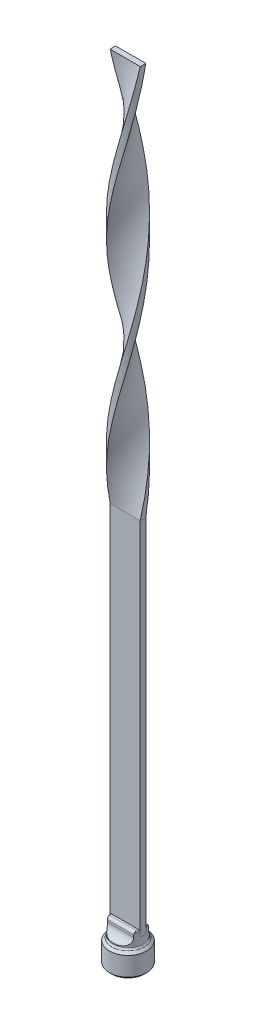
ISO-10303-21;
HEADER;
FILE_DESCRIPTION(('STEP AP214'),'2;1');
FILE_NAME('part.step','',(''),(''),'','','');
FILE_SCHEMA(('AUTOMOTIVE_DESIGN { 1 0 10303 214 1 1 1 1 }'));
ENDSEC;
DATA;
#1=APPLICATION_CONTEXT('core data for automotive mechanical design processes');
#2=APPLICATION_PROTOCOL_DEFINITION('international standard','automotive_design',2000,#1);
#3=PRODUCT_CONTEXT('',#1,'mechanical');
#4=PRODUCT('Part','Part','',(#3));
#5=PRODUCT_RELATED_PRODUCT_CATEGORY('part','',(#4));
#6=PRODUCT_DEFINITION_FORMATION('','',#4);
#7=PRODUCT_DEFINITION_CONTEXT('part definition',#1,'design');
#8=PRODUCT_DEFINITION('design','',#6,#7);
#9=PRODUCT_DEFINITION_SHAPE('','',#8);
#10=(LENGTH_UNIT() NAMED_UNIT(*) SI_UNIT(.MILLI.,.METRE.));
#11=(NAMED_UNIT(*) PLANE_ANGLE_UNIT() SI_UNIT($,.RADIAN.));
#12=(NAMED_UNIT(*) SI_UNIT($,.STERADIAN.) SOLID_ANGLE_UNIT());
#13=UNCERTAINTY_MEASURE_WITH_UNIT(LENGTH_MEASURE(1.E-05),#10,'distance_accuracy_value','');
#14=(GEOMETRIC_REPRESENTATION_CONTEXT(3) GLOBAL_UNCERTAINTY_ASSIGNED_CONTEXT((#13)) GLOBAL_UNIT_ASSIGNED_CONTEXT((#10,
#11,#12)) REPRESENTATION_CONTEXT('',''));
#15=CARTESIAN_POINT('',(0.,0.,0.));
#16=DIRECTION('',(0.,0.,1.));
#17=DIRECTION('',(1.,0.,0.));
#18=AXIS2_PLACEMENT_3D('',#15,#16,#17);
#19=CARTESIAN_POINT('',(-2.3622,0.,1.36381680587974));
#20=DIRECTION('',(-0.5,0.,0.866025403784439));
#21=DIRECTION('',(0.866025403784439,0.,0.5));
#22=AXIS2_PLACEMENT_3D('',#19,#20,#21);
#23=PLANE('',#22);
#24=DIRECTION('',(0.,1.,0.));
#25=VECTOR('',#24,1.);
#26=CARTESIAN_POINT('',(-2.3622,0.,1.36381680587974));
#27=LINE('',#26,#25);
#28=CARTESIAN_POINT('',(-2.36219999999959,0.0155663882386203,1.3638168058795));
#29=VERTEX_POINT('',#28);
#30=CARTESIAN_POINT('',(-2.3622,5.4102,1.36381680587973));
#31=VERTEX_POINT('',#30);
#32=EDGE_CURVE('E640',#29,#31,#27,.T.);
#33=ORIENTED_EDGE('',*,*,#32,.T.);
#34=DIRECTION('',(-0.866025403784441,0.,-0.5));
#35=VECTOR('',#34,1.);
#36=CARTESIAN_POINT('',(0.,5.4102,2.72763361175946));
#37=LINE('',#36,#35);
#38=CARTESIAN_POINT('',(0.,5.4102,2.72763361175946));
#39=VERTEX_POINT('',#38);
#40=EDGE_CURVE('E655',#39,#31,#37,.T.);
#41=ORIENTED_EDGE('',*,*,#40,.F.);
#42=DIRECTION('',(0.,1.,0.));
#43=VECTOR('',#42,1.);
#44=CARTESIAN_POINT('',(0.,0.,2.72763361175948));
#45=LINE('',#44,#43);
#46=CARTESIAN_POINT('',(-4.05896796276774E-13,0.0155663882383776,2.72763361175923));
#47=VERTEX_POINT('',#46);
#48=EDGE_CURVE('E336',#39,#47,#45,.F.);
#49=ORIENTED_EDGE('',*,*,#48,.T.);
#50=CARTESIAN_POINT('',(-2.36219999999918,0.0155663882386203,1.36381680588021));
#51=CARTESIAN_POINT('',(-2.28154043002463,0.0620917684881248,1.41038563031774));
#52=CARTESIAN_POINT('',(-2.19954081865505,0.105900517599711,1.45772812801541));
#53=CARTESIAN_POINT('',(-2.03230420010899,0.186202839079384,1.55428223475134));
#54=CARTESIAN_POINT('',(-1.94704980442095,0.222647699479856,1.60350388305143));
#55=CARTESIAN_POINT('',(-1.77407702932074,0.28558015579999,1.70336976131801));
#56=CARTESIAN_POINT('',(-1.686368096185,0.312101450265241,1.75400853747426));
#57=CARTESIAN_POINT('',(-1.50902744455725,0.352932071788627,1.85639621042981));
#58=CARTESIAN_POINT('',(-1.41940256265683,0.367279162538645,1.9081411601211));
#59=CARTESIAN_POINT('',(-1.3047260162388,0.376863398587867,1.97434969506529));
#60=CARTESIAN_POINT('',(-1.28001324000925,0.37841288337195,1.98861762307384));
#61=CARTESIAN_POINT('',(-1.23056804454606,0.38048128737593,2.01716481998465));
#62=CARTESIAN_POINT('',(-1.20583564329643,0.381000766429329,2.03144407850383));
#63=CARTESIAN_POINT('',(-1.11901839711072,0.38099807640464,2.08156803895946));
#64=CARTESIAN_POINT('',(-1.0569163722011,0.377719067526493,2.11742265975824));
#65=CARTESIAN_POINT('',(-0.933187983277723,0.364783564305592,2.18885727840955));
#66=CARTESIAN_POINT('',(-0.87156198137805,0.355122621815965,2.22443706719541));
#67=CARTESIAN_POINT('',(-0.748942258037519,0.329877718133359,2.29523159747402));
#68=CARTESIAN_POINT('',(-0.68795279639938,0.314266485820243,2.33044387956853));
#69=CARTESIAN_POINT('',(-0.567144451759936,0.277831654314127,2.40019260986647));
#70=CARTESIAN_POINT('',(-0.507326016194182,0.25700610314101,2.43472879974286));
#71=CARTESIAN_POINT('',(-0.370927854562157,0.203889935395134,2.51347831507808));
#72=CARTESIAN_POINT('',(-0.294808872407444,0.170040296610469,2.55742562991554));
#73=CARTESIAN_POINT('',(-0.145452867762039,0.0966774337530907,2.64365635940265));
#74=CARTESIAN_POINT('',(-0.0721958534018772,0.0572188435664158,2.68595131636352));
#75=CARTESIAN_POINT('',(-8.22908622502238E-13,0.0155663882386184,2.72763361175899));
#76=B_SPLINE_CURVE_WITH_KNOTS('',3,(#50,#51,#52,#53,#54,#55,#56,#57,#58,#59,#60,#61,#62,#63,#64,
#65,#66,#67,#68,#69,#70,#71,#72,#73,#74,#75),.UNSPECIFIED.,.F.,.F.,(4,2,2,2,2,2,2,2,2,2,2,2,4),
(0.,0.312550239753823,0.627104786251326,0.940581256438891,1.25308174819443,1.33880263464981,
1.42447691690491,1.63950252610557,1.85467816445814,2.07085208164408,2.28710704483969,
2.56941094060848,2.84913273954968),.UNSPECIFIED.);
#77=EDGE_CURVE('E298',#29,#47,#76,.T.);
#78=ORIENTED_EDGE('',*,*,#77,.F.);
#79=EDGE_LOOP('',(#33,#41,#49,#78));
#80=FACE_BOUND('',#79,.T.);
#81=ADVANCED_FACE('F15',(#80),#23,.F.);
#82=CARTESIAN_POINT('',(-2.3622,0.,-1.36381680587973));
#83=DIRECTION('',(-1.,0.,0.));
#84=DIRECTION('',(0.,0.,1.));
#85=AXIS2_PLACEMENT_3D('',#82,#83,#84);
#86=PLANE('',#85);
#87=DIRECTION('',(0.,1.,0.));
#88=VECTOR('',#87,1.);
#89=CARTESIAN_POINT('',(-2.3622,0.,-1.36381680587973));
#90=LINE('',#89,#88);
#91=CARTESIAN_POINT('',(-2.36219999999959,0.0155663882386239,-1.36381680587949));
#92=VERTEX_POINT('',#91);
#93=CARTESIAN_POINT('',(-2.3622,5.4102,-1.36381680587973));
#94=VERTEX_POINT('',#93);
#95=EDGE_CURVE('E335',#92,#94,#90,.T.);
#96=ORIENTED_EDGE('',*,*,#95,.T.);
#97=DIRECTION('',(0.,0.,-1.));
#98=VECTOR('',#97,1.);
#99=CARTESIAN_POINT('',(-2.3622,5.4102,0.));
#100=LINE('',#99,#98);
#101=EDGE_CURVE('E658',#31,#94,#100,.T.);
#102=ORIENTED_EDGE('',*,*,#101,.F.);
#103=ORIENTED_EDGE('',*,*,#32,.F.);
#104=CARTESIAN_POINT('',(-2.3622,0.015566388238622,-1.36381680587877));
#105=CARTESIAN_POINT('',(-2.3622,0.0620917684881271,-1.27067915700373));
#106=CARTESIAN_POINT('',(-2.3622,0.105900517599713,-1.17599416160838));
#107=CARTESIAN_POINT('',(-2.3622,0.186202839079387,-0.982885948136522));
#108=CARTESIAN_POINT('',(-2.3622,0.222647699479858,-0.884442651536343));
#109=CARTESIAN_POINT('',(-2.3622,0.285580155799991,-0.684710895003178));
#110=CARTESIAN_POINT('',(-2.3622,0.312101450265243,-0.583433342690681));
#111=CARTESIAN_POINT('',(-2.3622,0.352932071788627,-0.378657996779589));
#112=CARTESIAN_POINT('',(-2.3622,0.367279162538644,-0.275168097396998));
#113=CARTESIAN_POINT('',(-2.3622,0.376863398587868,-0.142751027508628));
#114=CARTESIAN_POINT('',(-2.3622,0.37841288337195,-0.11421517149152));
#115=CARTESIAN_POINT('',(-2.3622,0.380481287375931,-0.0571207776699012));
#116=CARTESIAN_POINT('',(-2.3622,0.38100076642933,-0.0285622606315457));
#117=CARTESIAN_POINT('',(-2.3622,0.38099807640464,0.0716856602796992));
#118=CARTESIAN_POINT('',(-2.3622,0.377719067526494,0.143394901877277));
#119=CARTESIAN_POINT('',(-2.3622,0.364783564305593,0.286264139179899));
#120=CARTESIAN_POINT('',(-2.3622,0.355122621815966,0.357423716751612));
#121=CARTESIAN_POINT('',(-2.3622,0.329877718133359,0.499012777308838));
#122=CARTESIAN_POINT('',(-2.3622,0.314266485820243,0.569437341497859));
#123=CARTESIAN_POINT('',(-2.3622,0.277831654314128,0.70893480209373));
#124=CARTESIAN_POINT('',(-2.3622,0.257006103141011,0.778007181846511));
#125=CARTESIAN_POINT('',(-2.3622,0.203889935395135,0.93550621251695));
#126=CARTESIAN_POINT('',(-2.3622,0.170040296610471,1.02340084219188));
#127=CARTESIAN_POINT('',(-2.3622,0.0966774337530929,1.1958623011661));
#128=CARTESIAN_POINT('',(-2.3622,0.0572188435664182,1.28045221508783));
#129=CARTESIAN_POINT('',(-2.3622,0.0155663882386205,1.36381680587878));
#130=B_SPLINE_CURVE_WITH_KNOTS('',3,(#104,#105,#106,#107,#108,#109,#110,#111,#112,#113,#114,
#115,#116,#117,#118,#119,#120,#121,#122,#123,#124,#125,#126,#127,#128,#129),.UNSPECIFIED.,.F.,
.F.,(4,2,2,2,2,2,2,2,2,2,2,2,4),(0.,0.312550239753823,0.627104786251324,0.940581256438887,
1.25308174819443,1.3388026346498,1.42447691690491,1.63950252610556,1.85467816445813,
2.07085208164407,2.28710704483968,2.56941094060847,2.84913273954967),.UNSPECIFIED.);
#131=EDGE_CURVE('E131',#92,#29,#130,.T.);
#132=ORIENTED_EDGE('',*,*,#131,.F.);
#133=EDGE_LOOP('',(#96,#102,#103,#132));
#134=FACE_BOUND('',#133,.T.);
#135=ADVANCED_FACE('F345',(#134),#86,.F.);
#136=CARTESIAN_POINT('',(0.,0.,2.72763361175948));
#137=DIRECTION('',(0.5,0.,0.866025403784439));
#138=DIRECTION('',(0.866025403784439,0.,-0.5));
#139=AXIS2_PLACEMENT_3D('',#136,#137,#138);
#140=PLANE('',#139);
#141=ORIENTED_EDGE('',*,*,#48,.F.);
#142=DIRECTION('',(-0.866025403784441,0.,0.5));
#143=VECTOR('',#142,1.);
#144=CARTESIAN_POINT('',(2.3622,5.4102,1.36381680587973));
#145=LINE('',#144,#143);
#146=CARTESIAN_POINT('',(2.3622,5.4102,1.36381680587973));
#147=VERTEX_POINT('',#146);
#148=EDGE_CURVE('E659',#147,#39,#145,.T.);
#149=ORIENTED_EDGE('',*,*,#148,.F.);
#150=DIRECTION('',(0.,1.,0.));
#151=VECTOR('',#150,1.);
#152=CARTESIAN_POINT('',(2.3622,0.,1.36381680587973));
#153=LINE('',#152,#151);
#154=CARTESIAN_POINT('',(2.36219999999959,0.0155663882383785,1.36381680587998));
#155=VERTEX_POINT('',#154);
#156=EDGE_CURVE('E694',#147,#155,#153,.F.);
#157=ORIENTED_EDGE('',*,*,#156,.T.);
#158=CARTESIAN_POINT('',(8.34335602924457E-13,0.0155663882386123,2.727633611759));
#159=CARTESIAN_POINT('',(0.0806595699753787,0.0620917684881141,2.68106478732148));
#160=CARTESIAN_POINT('',(0.162659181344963,0.105900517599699,2.63372228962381));
#161=CARTESIAN_POINT('',(0.329895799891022,0.186202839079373,2.53716818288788));
#162=CARTESIAN_POINT('',(0.415150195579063,0.222647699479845,2.48794653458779));
#163=CARTESIAN_POINT('',(0.588122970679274,0.285580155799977,2.3880806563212));
#164=CARTESIAN_POINT('',(0.675831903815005,0.312101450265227,2.33744188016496));
#165=CARTESIAN_POINT('',(0.853172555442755,0.352932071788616,2.23505420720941));
#166=CARTESIAN_POINT('',(0.942797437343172,0.367279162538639,2.18330925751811));
#167=CARTESIAN_POINT('',(1.0574739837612,0.376863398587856,2.11710072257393));
#168=CARTESIAN_POINT('',(1.08218675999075,0.378412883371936,2.10283279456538));
#169=CARTESIAN_POINT('',(1.13163195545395,0.380481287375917,2.07428559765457));
#170=CARTESIAN_POINT('',(1.15636435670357,0.381000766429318,2.06000633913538));
#171=CARTESIAN_POINT('',(1.24318160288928,0.380998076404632,2.00988237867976));
#172=CARTESIAN_POINT('',(1.3052836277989,0.377719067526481,1.97402775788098));
#173=CARTESIAN_POINT('',(1.42901201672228,0.364783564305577,1.90259313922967));
#174=CARTESIAN_POINT('',(1.49063801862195,0.355122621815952,1.86701335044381));
#175=CARTESIAN_POINT('',(1.61325774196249,0.329877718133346,1.7962188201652));
#176=CARTESIAN_POINT('',(1.67424720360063,0.314266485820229,1.76100653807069));
#177=CARTESIAN_POINT('',(1.79505554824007,0.277831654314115,1.69125780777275));
#178=CARTESIAN_POINT('',(1.85487398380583,0.257006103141,1.65672161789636));
#179=CARTESIAN_POINT('',(1.99127214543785,0.203889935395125,1.57797210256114));
#180=CARTESIAN_POINT('',(2.06739112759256,0.170040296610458,1.53402478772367));
#181=CARTESIAN_POINT('',(2.21674713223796,0.096677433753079,1.44779405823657));
#182=CARTESIAN_POINT('',(2.29000414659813,0.0572188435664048,1.4054991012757));
#183=CARTESIAN_POINT('',(2.36219999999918,0.0155663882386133,1.36381680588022));
#184=B_SPLINE_CURVE_WITH_KNOTS('',3,(#158,#159,#160,#161,#162,#163,#164,#165,#166,#167,#168,
#169,#170,#171,#172,#173,#174,#175,#176,#177,#178,#179,#180,#181,#182,#183),.UNSPECIFIED.,.F.,
.F.,(4,2,2,2,2,2,2,2,2,2,2,2,4),(0.,0.31255023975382,0.627104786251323,0.940581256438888,
1.25308174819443,1.3388026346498,1.4244769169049,1.63950252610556,1.85467816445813,
2.07085208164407,2.28710704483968,2.56941094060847,2.84913273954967),.UNSPECIFIED.);
#185=EDGE_CURVE('E329',#47,#155,#184,.T.);
#186=ORIENTED_EDGE('',*,*,#185,.F.);
#187=EDGE_LOOP('',(#141,#149,#157,#186));
#188=FACE_BOUND('',#187,.T.);
#189=ADVANCED_FACE('F341',(#188),#140,.F.);
#190=CARTESIAN_POINT('',(0.,0.,-2.72763361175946));
#191=DIRECTION('',(-0.5,0.,-0.866025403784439));
#192=DIRECTION('',(-0.866025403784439,0.,0.5));
#193=AXIS2_PLACEMENT_3D('',#190,#191,#192);
#194=PLANE('',#193);
#195=DIRECTION('',(0.,1.,0.));
#196=VECTOR('',#195,1.);
#197=CARTESIAN_POINT('',(0.,0.,-2.72763361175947));
#198=LINE('',#197,#196);
#199=CARTESIAN_POINT('',(0.,0.0155663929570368,-2.72763360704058));
#200=VERTEX_POINT('',#199);
#201=CARTESIAN_POINT('',(0.,5.4102,-2.72763361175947));
#202=VERTEX_POINT('',#201);
#203=EDGE_CURVE('E689',#200,#202,#198,.T.);
#204=ORIENTED_EDGE('',*,*,#203,.T.);
#205=DIRECTION('',(0.866025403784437,0.,-0.5));
#206=VECTOR('',#205,1.);
#207=CARTESIAN_POINT('',(-2.3622,5.4102,-1.36381680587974));
#208=LINE('',#207,#206);
#209=EDGE_CURVE('E667',#94,#202,#208,.T.);
#210=ORIENTED_EDGE('',*,*,#209,.F.);
#211=ORIENTED_EDGE('',*,*,#95,.F.);
#212=CARTESIAN_POINT('',(-6.58945370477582E-09,0.0155663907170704,-2.72763360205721));
#213=CARTESIAN_POINT('',(-0.0806595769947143,0.0620917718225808,-2.6810647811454));
#214=CARTESIAN_POINT('',(-0.162659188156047,0.105900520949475,-2.63372228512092));
#215=CARTESIAN_POINT('',(-0.329895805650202,0.186202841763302,-2.53716818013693));
#216=CARTESIAN_POINT('',(-0.415150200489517,0.222647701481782,-2.48794653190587));
#217=CARTESIAN_POINT('',(-0.588122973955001,0.285580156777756,-2.3880806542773));
#218=CARTESIAN_POINT('',(-0.675831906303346,0.312101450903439,-2.337441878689));
#219=CARTESIAN_POINT('',(-0.853172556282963,0.352932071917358,-2.23505420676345));
#220=CARTESIAN_POINT('',(-0.942797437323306,0.367279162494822,-2.18330925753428));
#221=CARTESIAN_POINT('',(-1.05747398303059,0.376863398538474,-2.11710072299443));
#222=CARTESIAN_POINT('',(-1.08218675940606,0.378412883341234,-2.10283279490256));
#223=CARTESIAN_POINT('',(-1.13163195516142,0.380481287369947,-2.07428559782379));
#224=CARTESIAN_POINT('',(-1.15636435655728,0.3810007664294,-2.06000633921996));
#225=CARTESIAN_POINT('',(-1.24318160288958,0.380998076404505,-2.00988237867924));
#226=CARTESIAN_POINT('',(-1.30528362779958,0.377719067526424,-1.97402775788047));
#227=CARTESIAN_POINT('',(-1.42901201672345,0.364783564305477,-1.90259313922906));
#228=CARTESIAN_POINT('',(-1.49063801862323,0.355122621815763,-1.86701335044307));
#229=CARTESIAN_POINT('',(-1.61325774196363,0.329877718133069,-1.79621882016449));
#230=CARTESIAN_POINT('',(-1.67424720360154,0.314266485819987,-1.76100653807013));
#231=CARTESIAN_POINT('',(-1.79505554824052,0.277831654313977,-1.69125780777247));
#232=CARTESIAN_POINT('',(-1.85487398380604,0.257006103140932,-1.65672161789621));
#233=CARTESIAN_POINT('',(-1.99127214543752,0.203889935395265,-1.5779721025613));
#234=CARTESIAN_POINT('',(-2.06739112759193,0.170040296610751,-1.53402478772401));
#235=CARTESIAN_POINT('',(-2.21674713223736,0.0966774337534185,-1.44779405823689));
#236=CARTESIAN_POINT('',(-2.29000414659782,0.0572188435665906,-1.40549910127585));
#237=CARTESIAN_POINT('',(-2.36219999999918,0.0155663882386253,-1.3638168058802));
#238=B_SPLINE_CURVE_WITH_KNOTS('',3,(#212,#213,#214,#215,#216,#217,#218,#219,#220,#221,#222,
#223,#224,#225,#226,#227,#228,#229,#230,#231,#232,#233,#234,#235,#236,#237),.UNSPECIFIED.,.F.,
.F.,(4,2,2,2,2,2,2,2,2,2,2,2,4),(0.,0.312550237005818,0.627104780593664,0.940581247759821,
1.25308173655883,1.33880262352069,1.42447690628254,1.63950251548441,1.8546781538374,
2.07085207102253,2.28710703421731,2.56941092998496,2.84913272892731),.UNSPECIFIED.);
#239=EDGE_CURVE('E322',#200,#92,#238,.T.);
#240=ORIENTED_EDGE('',*,*,#239,.F.);
#241=EDGE_LOOP('',(#204,#210,#211,#240));
#242=FACE_BOUND('',#241,.T.);
#243=ADVANCED_FACE('F344',(#242),#194,.F.);
#244=CARTESIAN_POINT('',(0.,5.4102,0.));
#245=DIRECTION('',(0.,-1.,0.));
#246=DIRECTION('',(0.,0.,-1.));
#247=AXIS2_PLACEMENT_3D('',#244,#245,#246);
#248=PLANE('',#247);
#249=ORIENTED_EDGE('',*,*,#101,.T.);
#250=ORIENTED_EDGE('',*,*,#209,.T.);
#251=DIRECTION('',(-0.866025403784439,0.,-0.5));
#252=VECTOR('',#251,1.);
#253=CARTESIAN_POINT('',(2.3622,5.4102,-1.36381680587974));
#254=LINE('',#253,#252);
#255=CARTESIAN_POINT('',(2.3622,5.4102,-1.36381680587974));
#256=VERTEX_POINT('',#255);
#257=EDGE_CURVE('E686',#202,#256,#254,.F.);
#258=ORIENTED_EDGE('',*,*,#257,.T.);
#259=DIRECTION('',(0.,0.,-1.));
#260=VECTOR('',#259,1.);
#261=CARTESIAN_POINT('',(2.3622,5.4102,1.36381680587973));
#262=LINE('',#261,#260);
#263=EDGE_CURVE('E683',#256,#147,#262,.F.);
#264=ORIENTED_EDGE('',*,*,#263,.T.);
#265=ORIENTED_EDGE('',*,*,#148,.T.);
#266=ORIENTED_EDGE('',*,*,#40,.T.);
#267=EDGE_LOOP('',(#249,#250,#258,#264,#265,#266));
#268=FACE_BOUND('',#267,.T.);
#269=ADVANCED_FACE('F1131',(#268),#248,.T.);
#270=CARTESIAN_POINT('',(2.3622,0.,1.36381680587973));
#271=DIRECTION('',(1.,0.,0.));
#272=DIRECTION('',(0.,0.,-1.));
#273=AXIS2_PLACEMENT_3D('',#270,#271,#272);
#274=PLANE('',#273);
#275=ORIENTED_EDGE('',*,*,#156,.F.);
#276=ORIENTED_EDGE('',*,*,#263,.F.);
#277=DIRECTION('',(0.,1.,0.));
#278=VECTOR('',#277,1.);
#279=CARTESIAN_POINT('',(2.3622,0.,-1.36381680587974));
#280=LINE('',#279,#278);
#281=CARTESIAN_POINT('',(2.3622,0.0155663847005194,-1.36381681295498));
#282=VERTEX_POINT('',#281);
#283=EDGE_CURVE('E688',#256,#282,#280,.F.);
#284=ORIENTED_EDGE('',*,*,#283,.T.);
#285=CARTESIAN_POINT('',(2.3622,0.0155663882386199,1.36381680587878));
#286=CARTESIAN_POINT('',(2.3622,0.062091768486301,1.27067915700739));
#287=CARTESIAN_POINT('',(2.3622,0.105900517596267,1.17599416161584));
#288=CARTESIAN_POINT('',(2.3622,0.186202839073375,0.982885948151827));
#289=CARTESIAN_POINT('',(2.3622,0.222647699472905,0.884442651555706));
#290=CARTESIAN_POINT('',(2.3622,0.285580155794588,0.684710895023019));
#291=CARTESIAN_POINT('',(2.3622,0.312101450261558,0.583433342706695));
#292=CARTESIAN_POINT('',(2.3622,0.352932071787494,0.378657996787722));
#293=CARTESIAN_POINT('',(2.3622,0.367279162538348,0.275168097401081));
#294=CARTESIAN_POINT('',(2.3622,0.376863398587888,0.142751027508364));
#295=CARTESIAN_POINT('',(2.3622,0.37841288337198,0.114215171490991));
#296=CARTESIAN_POINT('',(2.3622,0.380481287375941,0.057120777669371));
#297=CARTESIAN_POINT('',(2.3622,0.38100076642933,0.0285622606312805));
#298=CARTESIAN_POINT('',(2.3622,0.380998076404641,-0.0716856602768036));
#299=CARTESIAN_POINT('',(2.3622,0.377719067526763,-0.143394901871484));
#300=CARTESIAN_POINT('',(2.3622,0.364783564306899,-0.286264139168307));
#301=CARTESIAN_POINT('',(2.3622,0.355122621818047,-0.35742371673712));
#302=CARTESIAN_POINT('',(2.3622,0.329877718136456,-0.499012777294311));
#303=CARTESIAN_POINT('',(2.3622,0.314266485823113,-0.569437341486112));
#304=CARTESIAN_POINT('',(2.3622,0.277831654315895,-0.708934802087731));
#305=CARTESIAN_POINT('',(2.3622,0.257006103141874,-0.778007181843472));
#306=CARTESIAN_POINT('',(2.3622,0.203889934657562,-0.935506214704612));
#307=CARTESIAN_POINT('',(2.3622,0.170040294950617,-1.02340084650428));
#308=CARTESIAN_POINT('',(2.3622,0.096677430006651,-1.19586230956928));
#309=CARTESIAN_POINT('',(2.3622,0.0572188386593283,-1.28045222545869));
#310=CARTESIAN_POINT('',(2.3622,0.0155663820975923,-1.36381681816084));
#311=B_SPLINE_CURVE_WITH_KNOTS('',3,(#285,#286,#287,#288,#289,#290,#291,#292,#293,#294,#295,
#296,#297,#298,#299,#300,#301,#302,#303,#304,#305,#306,#307,#308,#309,#310),.UNSPECIFIED.,.F.,
.F.,(4,2,2,2,2,2,2,2,2,2,2,2,4),(0.,0.312550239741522,0.627104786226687,0.940581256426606,
1.25308174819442,1.33880263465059,1.4244769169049,1.63950252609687,1.85467816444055,
2.07085208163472,2.28710704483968,2.5694109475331,2.84913275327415),.UNSPECIFIED.);
#312=EDGE_CURVE('E316',#155,#282,#311,.T.);
#313=ORIENTED_EDGE('',*,*,#312,.F.);
#314=EDGE_LOOP('',(#275,#276,#284,#313));
#315=FACE_BOUND('',#314,.T.);
#316=ADVANCED_FACE('F1140',(#315),#274,.F.);
#317=CARTESIAN_POINT('',(2.3622,0.,-1.36381680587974));
#318=DIRECTION('',(0.5,0.,-0.866025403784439));
#319=DIRECTION('',(-0.866025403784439,0.,-0.5));
#320=AXIS2_PLACEMENT_3D('',#317,#318,#319);
#321=PLANE('',#320);
#322=ORIENTED_EDGE('',*,*,#283,.F.);
#323=ORIENTED_EDGE('',*,*,#257,.F.);
#324=ORIENTED_EDGE('',*,*,#203,.F.);
#325=CARTESIAN_POINT('',(8.17335955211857E-09,0.0155663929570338,-2.72763360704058));
#326=CARTESIAN_POINT('',(0.0806595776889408,0.0620917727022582,-2.68106478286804));
#327=CARTESIAN_POINT('',(0.16265918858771,0.105900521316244,-2.63372228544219));
#328=CARTESIAN_POINT('',(0.32989580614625,0.186202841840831,-2.5371681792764));
#329=CARTESIAN_POINT('',(0.41515020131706,0.222647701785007,-2.48794653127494));
#330=CARTESIAN_POINT('',(0.588122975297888,0.285580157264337,-2.38808065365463));
#331=CARTESIAN_POINT('',(0.675831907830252,0.31210145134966,-2.33744187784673));
#332=CARTESIAN_POINT('',(0.853172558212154,0.352932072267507,-2.23505420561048));
#333=CARTESIAN_POINT('',(0.942797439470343,0.367279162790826,-2.18330925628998));
#334=CARTESIAN_POINT('',(1.05747398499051,0.376863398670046,-2.11710072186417));
#335=CARTESIAN_POINT('',(1.08218676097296,0.378412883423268,-2.10283279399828));
#336=CARTESIAN_POINT('',(1.13163195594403,0.380481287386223,-2.0742855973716));
#337=CARTESIAN_POINT('',(1.15636435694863,0.381000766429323,-2.06000633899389));
#338=CARTESIAN_POINT('',(1.24318160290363,0.380998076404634,-2.00988237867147));
#339=CARTESIAN_POINT('',(1.30528362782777,0.377719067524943,-1.9740277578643));
#340=CARTESIAN_POINT('',(1.4290120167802,0.364783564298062,-1.90259313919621));
#341=CARTESIAN_POINT('',(1.4906380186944,0.355122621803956,-1.86701335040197));
#342=CARTESIAN_POINT('',(1.61325774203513,0.329877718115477,-1.79621882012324));
#343=CARTESIAN_POINT('',(1.67424720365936,0.314266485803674,-1.76100653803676));
#344=CARTESIAN_POINT('',(1.79505554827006,0.277831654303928,-1.69125780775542));
#345=CARTESIAN_POINT('',(1.85487398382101,0.257006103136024,-1.65672161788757));
#346=CARTESIAN_POINT('',(1.99127213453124,0.203889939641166,-1.57797210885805));
#347=CARTESIAN_POINT('',(2.06739110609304,0.170040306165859,-1.53402480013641));
#348=CARTESIAN_POINT('',(2.21674709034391,0.0966774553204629,-1.4477940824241));
#349=CARTESIAN_POINT('',(2.29000409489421,0.0572188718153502,-1.40549913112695));
#350=CARTESIAN_POINT('',(2.362199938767,0.0155664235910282,-1.36381684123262));
#351=B_SPLINE_CURVE_WITH_KNOTS('',3,(#325,#326,#327,#328,#329,#330,#331,#332,#333,#334,#335,
#336,#337,#338,#339,#340,#341,#342,#343,#344,#345,#346,#347,#348,#349,#350),.UNSPECIFIED.,.F.,
.F.,(4,2,2,2,2,2,2,2,2,2,2,2,4),(0.,0.312550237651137,0.627104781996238,0.940581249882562,
1.25308173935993,1.33880262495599,1.42447690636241,1.63950251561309,1.85467815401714,
2.07085207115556,2.28710703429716,2.56941089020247,2.84913264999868),.UNSPECIFIED.);
#352=EDGE_CURVE('E308',#200,#282,#351,.T.);
#353=ORIENTED_EDGE('',*,*,#352,.T.);
#354=EDGE_LOOP('',(#322,#323,#324,#353));
#355=FACE_BOUND('',#354,.T.);
#356=ADVANCED_FACE('F291',(#355),#321,.F.);
#357=CARTESIAN_POINT('',(0.,-5.68440337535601E-11,0.));
#358=DIRECTION('',(0.,-1.,0.));
#359=DIRECTION('',(0.,0.,-1.));
#360=AXIS2_PLACEMENT_3D('',#357,#358,#359);
#361=CONICAL_SURFACE('',#360,2.74320000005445,0.785398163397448);
#362=CARTESIAN_POINT('',(0.,-5.68444674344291E-11,0.));
#363=DIRECTION('',(0.,-1.,0.));
#364=DIRECTION('',(0.,0.,-1.));
#365=AXIS2_PLACEMENT_3D('',#362,#363,#364);
#366=CIRCLE('',#365,2.74320000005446);
#367=CARTESIAN_POINT('',(0.,-5.68450823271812E-11,-2.74320000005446));
#368=VERTEX_POINT('',#367);
#369=EDGE_CURVE('E718',#368,#368,#366,.F.);
#370=ORIENTED_EDGE('',*,*,#369,.F.);
#371=EDGE_LOOP('',(#370));
#372=FACE_BOUND('',#371,.T.);
#373=ORIENTED_EDGE('',*,*,#352,.F.);
#374=ORIENTED_EDGE('',*,*,#239,.T.);
#375=ORIENTED_EDGE('',*,*,#131,.T.);
#376=ORIENTED_EDGE('',*,*,#77,.T.);
#377=ORIENTED_EDGE('',*,*,#185,.T.);
#378=ORIENTED_EDGE('',*,*,#312,.T.);
#379=EDGE_LOOP('',(#373,#374,#375,#376,#377,#378));
#380=FACE_BOUND('',#379,.T.);
#381=ADVANCED_FACE('F286',(#372,#380),#361,.F.);
#382=CARTESIAN_POINT('',(0.,0.,-2.3622));
#383=DIRECTION('',(0.,-1.,0.));
#384=DIRECTION('',(0.,0.,-1.));
#385=AXIS2_PLACEMENT_3D('',#382,#383,#384);
#386=PLANE('',#385);
#387=ORIENTED_EDGE('',*,*,#369,.T.);
#388=EDGE_LOOP('',(#387));
#389=FACE_BOUND('',#388,.T.);
#390=CARTESIAN_POINT('',(0.,-1.13686946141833E-10,0.));
#391=DIRECTION('',(0.,1.,0.));
#392=DIRECTION('',(0.,0.,1.));
#393=AXIS2_PLACEMENT_3D('',#390,#391,#392);
#394=CIRCLE('',#393,4.19099999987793);
#395=CARTESIAN_POINT('',(0.,-1.13686001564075E-10,4.19099999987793));
#396=VERTEX_POINT('',#395);
#397=EDGE_CURVE('E713',#396,#396,#394,.T.);
#398=ORIENTED_EDGE('',*,*,#397,.F.);
#399=EDGE_LOOP('',(#398));
#400=FACE_BOUND('',#399,.T.);
#401=ADVANCED_FACE('F282',(#389,#400),#386,.T.);
#402=CARTESIAN_POINT('',(0.,0.619499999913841,0.));
#403=DIRECTION('',(0.,1.,0.));
#404=DIRECTION('',(0.,0.,1.));
#405=AXIS2_PLACEMENT_3D('',#402,#403,#404);
#406=CONICAL_SURFACE('',#405,4.81049999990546,0.785398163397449);
#407=CARTESIAN_POINT('',(0.,0.6195,0.));
#408=DIRECTION('',(0.,-1.,0.));
#409=DIRECTION('',(0.,0.,-1.));
#410=AXIS2_PLACEMENT_3D('',#407,#408,#409);
#411=CIRCLE('',#410,4.8105);
#412=CARTESIAN_POINT('',(0.,0.619499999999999,-4.8105));
#413=VERTEX_POINT('',#412);
#414=EDGE_CURVE('E709',#413,#413,#411,.F.);
#415=ORIENTED_EDGE('',*,*,#414,.F.);
#416=EDGE_LOOP('',(#415));
#417=FACE_BOUND('',#416,.T.);
#418=ORIENTED_EDGE('',*,*,#397,.T.);
#419=EDGE_LOOP('',(#418));
#420=FACE_BOUND('',#419,.T.);
#421=ADVANCED_FACE('F278',(#417,#420),#406,.T.);
#422=CARTESIAN_POINT('',(0.,3.048,0.));
#423=DIRECTION('',(0.,-1.,0.));
#424=DIRECTION('',(0.,0.,-1.));
#425=AXIS2_PLACEMENT_3D('',#422,#423,#424);
#426=CYLINDRICAL_SURFACE('',#425,4.8105);
#427=CARTESIAN_POINT('',(0.,5.47649999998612,0.));
#428=DIRECTION('',(0.,-1.,0.));
#429=DIRECTION('',(0.,0.,1.));
#430=AXIS2_PLACEMENT_3D('',#427,#428,#429);
#431=CIRCLE('',#430,4.81050000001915);
#432=CARTESIAN_POINT('',(0.,5.47649999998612,4.81050000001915));
#433=VERTEX_POINT('',#432);
#434=EDGE_CURVE('E706',#433,#433,#431,.F.);
#435=ORIENTED_EDGE('',*,*,#434,.F.);
#436=EDGE_LOOP('',(#435));
#437=FACE_BOUND('',#436,.T.);
#438=ORIENTED_EDGE('',*,*,#414,.T.);
#439=EDGE_LOOP('',(#438));
#440=FACE_BOUND('',#439,.T.);
#441=ADVANCED_FACE('F274',(#437,#440),#426,.T.);
#442=CARTESIAN_POINT('',(0.,5.4765000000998,0.));
#443=DIRECTION('',(0.,-1.,0.));
#444=DIRECTION('',(0.,0.,-1.));
#445=AXIS2_PLACEMENT_3D('',#442,#443,#444);
#446=CONICAL_SURFACE('',#445,4.81049999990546,0.785398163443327);
#447=CARTESIAN_POINT('',(0.,6.096,0.));
#448=DIRECTION('',(0.,-1.,0.));
#449=DIRECTION('',(0.,0.,-1.));
#450=AXIS2_PLACEMENT_3D('',#447,#448,#449);
#451=CIRCLE('',#450,4.191);
#452=CARTESIAN_POINT('',(0.,6.096,-4.191));
#453=VERTEX_POINT('',#452);
#454=EDGE_CURVE('E240',#453,#453,#451,.T.);
#455=ORIENTED_EDGE('',*,*,#454,.T.);
#456=EDGE_LOOP('',(#455));
#457=FACE_BOUND('',#456,.T.);
#458=ORIENTED_EDGE('',*,*,#434,.T.);
#459=EDGE_LOOP('',(#458));
#460=FACE_BOUND('',#459,.T.);
#461=ADVANCED_FACE('F268',(#457,#460),#446,.T.);
#462=CARTESIAN_POINT('',(0.,6.5615896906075,0.));
#463=DIRECTION('',(0.,-1.,0.));
#464=DIRECTION('',(0.,0.,-1.));
#465=AXIS2_PLACEMENT_3D('',#462,#463,#464);
#466=TOROIDAL_SURFACE('',#465,4.39420000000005,0.508);
#467=ORIENTED_EDGE('',*,*,#454,.F.);
#468=EDGE_LOOP('',(#467));
#469=FACE_BOUND('',#468,.T.);
#470=CARTESIAN_POINT('',(0.,6.5615896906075,0.));
#471=DIRECTION('',(0.,-1.,0.));
#472=DIRECTION('',(0.,0.,-1.));
#473=AXIS2_PLACEMENT_3D('',#470,#471,#472);
#474=CIRCLE('',#473,3.8862);
#475=CARTESIAN_POINT('',(0.,6.5615896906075,-3.8862));
#476=VERTEX_POINT('',#475);
#477=EDGE_CURVE('E237',#476,#476,#474,.F.);
#478=ORIENTED_EDGE('',*,*,#477,.F.);
#479=EDGE_LOOP('',(#478));
#480=FACE_BOUND('',#479,.T.);
#481=ADVANCED_FACE('F263',(#469,#480),#466,.F.);
#482=CARTESIAN_POINT('',(0.,8.763,-3.8608));
#483=DIRECTION('',(1.,0.,0.));
#484=DIRECTION('',(0.,0.,-1.));
#485=AXIS2_PLACEMENT_3D('',#482,#483,#484);
#486=CYLINDRICAL_SURFACE('',#485,1.9558);
#487=DIRECTION('',(1.,0.,0.));
#488=VECTOR('',#487,1.);
#489=CARTESIAN_POINT('',(0.,8.763,-1.905));
#490=LINE('',#489,#488);
#491=CARTESIAN_POINT('',(-3.38725928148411,8.763,-1.905));
#492=VERTEX_POINT('',#491);
#493=CARTESIAN_POINT('',(3.38725928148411,8.763,-1.905));
#494=VERTEX_POINT('',#493);
#495=EDGE_CURVE('E241',#492,#494,#490,.T.);
#496=ORIENTED_EDGE('',*,*,#495,.T.);
#497=CARTESIAN_POINT('',(-3.3872592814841,8.763,-1.905));
#498=CARTESIAN_POINT('',(-3.38725570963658,8.7148407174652,-1.90499261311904));
#499=CARTESIAN_POINT('',(-3.38625874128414,8.66668356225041,-1.9067786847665));
#500=CARTESIAN_POINT('',(-3.3822530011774,8.57071712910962,-1.91388232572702));
#501=CARTESIAN_POINT('',(-3.379244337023,8.52290783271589,-1.91919970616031));
#502=CARTESIAN_POINT('',(-3.37119526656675,8.42803523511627,-1.93330167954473));
#503=CARTESIAN_POINT('',(-3.36615742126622,8.38097107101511,-1.94208190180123));
#504=CARTESIAN_POINT('',(-3.35400900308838,8.2878785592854,-1.96298723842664));
#505=CARTESIAN_POINT('',(-3.3468984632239,8.24185019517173,-1.97511229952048));
#506=CARTESIAN_POINT('',(-3.32236041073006,8.10575585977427,-2.01631092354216));
#507=CARTESIAN_POINT('',(-3.30172410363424,8.01765158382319,-2.05021234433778));
#508=CARTESIAN_POINT('',(-3.25146765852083,7.84938541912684,-2.12900761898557));
#509=CARTESIAN_POINT('',(-3.22185082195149,7.76922062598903,-2.17389743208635));
#510=CARTESIAN_POINT('',(-3.15316008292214,7.61834138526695,-2.27238614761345));
#511=CARTESIAN_POINT('',(-3.11404442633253,7.54767086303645,-2.32602314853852));
#512=CARTESIAN_POINT('',(-3.0265017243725,7.41741024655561,-2.43883726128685));
#513=CARTESIAN_POINT('',(-2.97807163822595,7.35782378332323,-2.49801617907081));
#514=CARTESIAN_POINT('',(-2.8694009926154,7.24691267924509,-2.62226563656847));
#515=CARTESIAN_POINT('',(-2.80864060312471,7.19626216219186,-2.68747915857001));
#516=CARTESIAN_POINT('',(-2.67837529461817,7.10693990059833,-2.81732404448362));
#517=CARTESIAN_POINT('',(-2.60886725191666,7.06827245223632,-2.88195519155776));
#518=CARTESIAN_POINT('',(-2.48100281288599,7.00992317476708,-2.99205611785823));
#519=CARTESIAN_POINT('',(-2.42428144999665,6.98791322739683,-3.03823265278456));
#520=CARTESIAN_POINT('',(-2.30719039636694,6.94898008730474,-3.12807709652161));
#521=CARTESIAN_POINT('',(-2.24681922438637,6.93205897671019,-3.17174397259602));
#522=CARTESIAN_POINT('',(-2.1227856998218,6.9025016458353,-3.25606705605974));
#523=CARTESIAN_POINT('',(-2.05911524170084,6.88987661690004,-3.29671518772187));
#524=CARTESIAN_POINT('',(-1.92905419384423,6.86820055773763,-3.37446958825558));
#525=CARTESIAN_POINT('',(-1.86266288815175,6.85915047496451,-3.41157491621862));
#526=CARTESIAN_POINT('',(-1.70460609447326,6.84131798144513,-3.49389104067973));
#527=CARTESIAN_POINT('',(-1.61201450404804,6.83367027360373,-3.53757497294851));
#528=CARTESIAN_POINT('',(-1.42345677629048,6.82196223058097,-3.61757113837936));
#529=CARTESIAN_POINT('',(-1.32748911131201,6.81790354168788,-3.65387998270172));
#530=CARTESIAN_POINT('',(-1.1331164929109,6.81209439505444,-3.71874654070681));
#531=CARTESIAN_POINT('',(-1.03471657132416,6.81033952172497,-3.74731899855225));
#532=CARTESIAN_POINT('',(-0.836005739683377,6.80809840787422,-3.79659244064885));
#533=CARTESIAN_POINT('',(-0.73569608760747,6.80761135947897,-3.81729843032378));
#534=CARTESIAN_POINT('',(-0.603004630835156,6.80731180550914,-3.83926717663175));
#535=CARTESIAN_POINT('',(-0.571191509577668,6.80726577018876,-3.84412873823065));
#536=CARTESIAN_POINT('',(-0.507466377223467,6.80721040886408,-3.85305898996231));
#537=CARTESIAN_POINT('',(-0.475554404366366,6.80720107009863,-3.85712795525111));
#538=CARTESIAN_POINT('',(-0.296579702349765,6.80719507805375,-3.87768966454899));
#539=CARTESIAN_POINT('',(-0.148499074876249,6.80736508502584,-3.88618222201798));
#540=CARTESIAN_POINT('',(0.14791805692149,6.80736479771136,-3.88621776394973));
#541=CARTESIAN_POINT('',(0.296254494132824,6.80719383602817,-3.87772750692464));
#542=CARTESIAN_POINT('',(0.550435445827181,6.80720446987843,-3.84852481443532));
#543=CARTESIAN_POINT('',(0.656753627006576,6.80730208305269,-3.83181281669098));
#544=CARTESIAN_POINT('',(0.867679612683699,6.80838054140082,-3.78962438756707));
#545=CARTESIAN_POINT('',(0.972286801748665,6.80936169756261,-3.76414487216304));
#546=CARTESIAN_POINT('',(1.17901991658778,6.81321973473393,-3.70459539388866));
#547=CARTESIAN_POINT('',(1.28114552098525,6.81609685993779,-3.67052432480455));
#548=CARTESIAN_POINT('',(1.48204061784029,6.82508618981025,-3.59411634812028));
#549=CARTESIAN_POINT('',(1.58081143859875,6.83119709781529,-3.55178275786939));
#550=CARTESIAN_POINT('',(1.81745861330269,6.85211370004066,-3.43850966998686));
#551=CARTESIAN_POINT('',(1.95312022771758,6.8695822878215,-3.36323439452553));
#552=CARTESIAN_POINT('',(2.14737923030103,6.907866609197,-3.23994164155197));
#553=CARTESIAN_POINT('',(2.21055654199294,6.92262856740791,-3.1971442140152));
#554=CARTESIAN_POINT('',(2.33342371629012,6.95700682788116,-3.10860278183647));
#555=CARTESIAN_POINT('',(2.39311452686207,6.97662180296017,-3.06285958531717));
#556=CARTESIAN_POINT('',(2.53879072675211,7.03332416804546,-2.94446974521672));
#557=CARTESIAN_POINT('',(2.62214063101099,7.07417923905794,-2.87029971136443));
#558=CARTESIAN_POINT('',(2.77748393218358,7.17169222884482,-2.72025091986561));
#559=CARTESIAN_POINT('',(2.84948224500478,7.22834327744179,-2.64437291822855));
#560=CARTESIAN_POINT('',(2.9478974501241,7.32633240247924,-2.53278061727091));
#561=CARTESIAN_POINT('',(2.97923781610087,7.36137274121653,-2.49577449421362));
#562=CARTESIAN_POINT('',(3.03843684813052,7.43575387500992,-2.42335077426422));
#563=CARTESIAN_POINT('',(3.06629726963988,7.47509248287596,-2.38793238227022));
#564=CARTESIAN_POINT('',(3.11844570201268,7.55793353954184,-2.31941890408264));
#565=CARTESIAN_POINT('',(3.1427343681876,7.60143522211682,-2.28632339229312));
#566=CARTESIAN_POINT('',(3.18771965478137,7.69230089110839,-2.22317254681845));
#567=CARTESIAN_POINT('',(3.20841688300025,7.73966422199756,-2.19311669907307));
#568=CARTESIAN_POINT('',(3.25981389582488,7.87306795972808,-2.11649934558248));
#569=CARTESIAN_POINT('',(3.28708686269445,7.96255255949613,-2.07349849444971));
#570=CARTESIAN_POINT('',(3.33163834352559,8.1491327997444,-2.00113994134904));
#571=CARTESIAN_POINT('',(3.34892235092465,8.24622422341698,-1.97177474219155));
#572=CARTESIAN_POINT('',(3.37015846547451,8.41373737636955,-1.93516964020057));
#573=CARTESIAN_POINT('',(3.37659011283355,8.48299541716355,-1.92388146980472));
#574=CARTESIAN_POINT('',(3.38512933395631,8.62249233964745,-1.90878757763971));
#575=CARTESIAN_POINT('',(3.38724256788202,8.6927298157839,-1.90497206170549));
#576=CARTESIAN_POINT('',(3.3872592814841,8.763,-1.905));
#577=B_SPLINE_CURVE_WITH_KNOTS('',3,(#497,#498,#499,#500,#501,#502,#503,#504,#505,#506,#507,
#508,#509,#510,#511,#512,#513,#514,#515,#516,#517,#518,#519,#520,#521,#522,#523,#524,#525,#526,
#527,#528,#529,#530,#531,#532,#533,#534,#535,#536,#537,#538,#539,#540,#541,#542,#543,#544,#545,
#546,#547,#548,#549,#550,#551,#552,#553,#554,#555,#556,#557,#558,#559,#560,#561,#562,#563,#564,
#565,#566,#567,#568,#569,#570,#571,#572,#573,#574,#575,#576),.UNSPECIFIED.,.F.,.F.,(4,2,2,2,2,2,
2,2,2,2,2,2,2,2,2,2,2,2,2,2,2,2,2,2,2,2,2,2,2,2,2,2,2,2,2,2,2,2,2,4),(0.,0.144430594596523,
0.288853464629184,0.433094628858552,0.577333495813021,0.865723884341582,1.15400838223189,
1.44358379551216,1.73325390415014,2.03961952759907,2.34609486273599,2.57493938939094,
2.80387742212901,3.03340735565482,3.26299807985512,3.57056039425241,3.87826371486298,
4.18537641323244,4.49229336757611,4.58883335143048,4.68533976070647,5.12922347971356,
5.57397688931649,5.89649518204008,6.21912703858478,6.54180045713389,6.86434458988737,
7.33080072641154,7.56373638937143,7.79660842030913,8.15166051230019,8.50655842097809,
8.68581028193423,8.86497135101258,9.0440995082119,9.22319732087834,9.53032909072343,
9.83729179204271,10.0481809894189,10.2587935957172),.UNSPECIFIED.);
#578=EDGE_CURVE('E770',#492,#494,#577,.T.);
#579=ORIENTED_EDGE('',*,*,#578,.F.);
#580=EDGE_LOOP('',(#496,#579));
#581=FACE_BOUND('',#580,.T.);
#582=ADVANCED_FACE('F267',(#581),#486,.F.);
#583=CARTESIAN_POINT('',(0.,6.8072,6.8326002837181));
#584=DIRECTION('',(0.,-1.,0.));
#585=DIRECTION('',(0.,0.,-1.));
#586=AXIS2_PLACEMENT_3D('',#583,#584,#585);
#587=PLANE('',#586);
#588=DIRECTION('',(1.,0.,0.));
#589=VECTOR('',#588,1.);
#590=CARTESIAN_POINT('',(0.,6.8072,3.8608));
#591=LINE('',#590,#589);
#592=CARTESIAN_POINT('',(0.443591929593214,6.8072,3.8608));
#593=VERTEX_POINT('',#592);
#594=CARTESIAN_POINT('',(-0.443591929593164,6.8072,3.8608));
#595=VERTEX_POINT('',#594);
#596=EDGE_CURVE('E936',#593,#595,#591,.F.);
#597=ORIENTED_EDGE('',*,*,#596,.T.);
#598=CARTESIAN_POINT('',(0.,6.8072,0.));
#599=DIRECTION('',(0.,-1.,0.));
#600=DIRECTION('',(0.,0.,-1.));
#601=AXIS2_PLACEMENT_3D('',#598,#599,#600);
#602=CIRCLE('',#601,3.8862);
#603=EDGE_CURVE('E903',#593,#595,#602,.T.);
#604=ORIENTED_EDGE('',*,*,#603,.F.);
#605=EDGE_LOOP('',(#597,#604));
#606=FACE_BOUND('',#605,.T.);
#607=ADVANCED_FACE('F945',(#606),#587,.F.);
#608=CARTESIAN_POINT('',(0.,8.0391000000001,0.));
#609=DIRECTION('',(0.,-1.,0.));
#610=DIRECTION('',(0.,0.,-1.));
#611=AXIS2_PLACEMENT_3D('',#608,#609,#610);
#612=CYLINDRICAL_SURFACE('',#611,3.8862);
#613=ORIENTED_EDGE('',*,*,#603,.T.);
#614=CARTESIAN_POINT('',(-0.443591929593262,6.8072,3.8608));
#615=CARTESIAN_POINT('',(-0.496770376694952,6.80720289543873,3.85469007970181));
#616=CARTESIAN_POINT('',(-0.549816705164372,6.80722828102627,3.84748182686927));
#617=CARTESIAN_POINT('',(-0.655566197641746,6.80741069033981,3.83088087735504));
#618=CARTESIAN_POINT('',(-0.7082693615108,6.80756771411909,3.82148817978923));
#619=CARTESIAN_POINT('',(-0.865821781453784,6.80836661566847,3.79003656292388));
#620=CARTESIAN_POINT('',(-0.970036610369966,6.80933657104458,3.7647130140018));
#621=CARTESIAN_POINT('',(-1.17685705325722,6.81316280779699,3.70529703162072));
#622=CARTESIAN_POINT('',(-1.27944165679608,6.81603494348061,3.67113238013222));
#623=CARTESIAN_POINT('',(-1.481216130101,6.82503516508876,3.59446947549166));
#624=CARTESIAN_POINT('',(-1.58040786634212,6.83116142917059,3.55197589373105));
#625=CARTESIAN_POINT('',(-1.81760152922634,6.85212632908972,3.43844131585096));
#626=CARTESIAN_POINT('',(-1.95339659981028,6.86961779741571,3.36308084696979));
#627=CARTESIAN_POINT('',(-2.14770284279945,6.90793985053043,3.23972525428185));
#628=CARTESIAN_POINT('',(-2.21081081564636,6.92269378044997,3.19696653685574));
#629=CARTESIAN_POINT('',(-2.33354564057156,6.95704689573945,3.10850935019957));
#630=CARTESIAN_POINT('',(-2.39317344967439,6.9766447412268,3.06281169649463));
#631=CARTESIAN_POINT('',(-2.53877657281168,7.03331865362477,2.94448125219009));
#632=CARTESIAN_POINT('',(-2.62211385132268,7.07416607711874,2.87032358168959));
#633=CARTESIAN_POINT('',(-2.77746079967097,7.17167407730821,2.72027525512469));
#634=CARTESIAN_POINT('',(-2.84947176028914,7.22833285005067,2.64438479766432));
#635=CARTESIAN_POINT('',(-2.94789745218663,7.32633239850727,2.5327806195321));
#636=CARTESIAN_POINT('',(-2.97923780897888,7.36137273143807,2.49577450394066));
#637=CARTESIAN_POINT('',(-3.03843682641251,7.43575384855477,2.42335079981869));
#638=CARTESIAN_POINT('',(-3.06629724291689,7.47509244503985,2.3879324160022));
#639=CARTESIAN_POINT('',(-3.11844567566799,7.55793349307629,2.31941894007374));
#640=CARTESIAN_POINT('',(-3.14273434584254,7.60143518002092,2.28632342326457));
#641=CARTESIAN_POINT('',(-3.18771964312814,7.69230086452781,2.22317256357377));
#642=CARTESIAN_POINT('',(-3.20841687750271,7.7396642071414,2.1931167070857));
#643=CARTESIAN_POINT('',(-3.25981437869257,7.87306921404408,2.11649862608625));
#644=CARTESIAN_POINT('',(-3.28708767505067,7.96255522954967,2.07349721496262));
#645=CARTESIAN_POINT('',(-3.33163886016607,8.14913569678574,2.00113906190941));
#646=CARTESIAN_POINT('',(-3.3489225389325,8.24622570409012,1.97177441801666));
#647=CARTESIAN_POINT('',(-3.37015829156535,8.41373600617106,1.93516994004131));
#648=CARTESIAN_POINT('',(-3.37658985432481,8.48299263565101,1.92388192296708));
#649=CARTESIAN_POINT('',(-3.38512924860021,8.62248951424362,1.90878773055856));
#650=CARTESIAN_POINT('',(-3.3872425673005,8.69272840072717,1.90497206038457));
#651=CARTESIAN_POINT('',(-3.3872592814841,8.763,1.905));
#652=B_SPLINE_CURVE_WITH_KNOTS('',3,(#614,#615,#616,#617,#618,#619,#620,#621,#622,#623,#624,
#625,#626,#627,#628,#629,#630,#631,#632,#633,#634,#635,#636,#637,#638,#639,#640,#641,#642,#643,
#644,#645,#646,#647,#648,#649,#650,#651),.UNSPECIFIED.,.F.,.F.,(4,2,2,2,2,2,2,2,2,2,2,2,2,2,2,2,
2,2,4),(0.,0.160561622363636,0.321123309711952,0.642479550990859,0.966548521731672,
1.29043625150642,1.75736607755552,1.99006477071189,2.2226991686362,2.57769439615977,
2.93264913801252,3.11190097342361,3.29106199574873,3.47019017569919,3.64928803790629,
3.95642437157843,4.26338250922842,4.47426748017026,4.68488431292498),.UNSPECIFIED.);
#653=CARTESIAN_POINT('',(-3.3872592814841,8.763,1.905));
#654=VERTEX_POINT('',#653);
#655=EDGE_CURVE('E956',#595,#654,#652,.T.);
#656=ORIENTED_EDGE('',*,*,#655,.T.);
#657=DIRECTION('',(0.,-1.,0.));
#658=VECTOR('',#657,1.);
#659=CARTESIAN_POINT('',(-3.3872592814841,8.0391000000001,1.905));
#660=LINE('',#659,#658);
#661=CARTESIAN_POINT('',(-3.3872592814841,9.3472,1.905));
#662=VERTEX_POINT('',#661);
#663=EDGE_CURVE('E228',#654,#662,#660,.F.);
#664=ORIENTED_EDGE('',*,*,#663,.T.);
#665=CARTESIAN_POINT('',(-3.3872592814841,9.3472,1.905));
#666=CARTESIAN_POINT('',(-3.38722204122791,9.37994998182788,1.90504193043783));
#667=CARTESIAN_POINT('',(-3.3886823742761,9.41265701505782,1.90246983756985));
#668=CARTESIAN_POINT('',(-3.39430564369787,9.47699420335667,1.89243137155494));
#669=CARTESIAN_POINT('',(-3.39846171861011,9.50862687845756,1.88497742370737));
#670=CARTESIAN_POINT('',(-3.40918052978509,9.5699646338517,1.86551704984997));
#671=CARTESIAN_POINT('',(-3.41574051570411,9.59967187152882,1.85351582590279));
#672=CARTESIAN_POINT('',(-3.43081128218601,9.65652283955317,1.8254691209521));
#673=CARTESIAN_POINT('',(-3.43931940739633,9.68366998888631,1.8094291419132));
#674=CARTESIAN_POINT('',(-3.45086653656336,9.71569274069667,1.78720332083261));
#675=CARTESIAN_POINT('',(-3.4532192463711,9.72199587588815,1.78265387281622));
#676=CARTESIAN_POINT('',(-3.45561375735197,9.7282,1.778));
#677=B_SPLINE_CURVE_WITH_KNOTS('',3,(#665,#666,#667,#668,#669,#670,#671,#672,#673,#674,#675,
#676),.UNSPECIFIED.,.F.,.F.,(4,2,2,2,2,4),(0.,0.0980499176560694,0.195851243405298,
0.293541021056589,0.391098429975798,0.415456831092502),.UNSPECIFIED.);
#678=CARTESIAN_POINT('',(-3.45561375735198,9.7282,1.778));
#679=VERTEX_POINT('',#678);
#680=EDGE_CURVE('E226',#662,#679,#677,.T.);
#681=ORIENTED_EDGE('',*,*,#680,.T.);
#682=CARTESIAN_POINT('',(0.,9.7282,0.));
#683=DIRECTION('',(0.,-1.,0.));
#684=DIRECTION('',(0.,0.,-1.));
#685=AXIS2_PLACEMENT_3D('',#682,#683,#684);
#686=CIRCLE('',#685,3.8862);
#687=CARTESIAN_POINT('',(-3.81818271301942,9.7282,0.7239));
#688=VERTEX_POINT('',#687);
#689=EDGE_CURVE('E210',#679,#688,#686,.T.);
#690=ORIENTED_EDGE('',*,*,#689,.T.);
#691=DIRECTION('',(0.,-1.,0.));
#692=VECTOR('',#691,1.);
#693=CARTESIAN_POINT('',(-3.8181827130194,8.0391000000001,0.7239));
#694=LINE('',#693,#692);
#695=CARTESIAN_POINT('',(-3.8181827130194,8.4582,0.7239));
#696=VERTEX_POINT('',#695);
#697=EDGE_CURVE('E201',#688,#696,#694,.T.);
#698=ORIENTED_EDGE('',*,*,#697,.T.);
#699=CARTESIAN_POINT('',(0.,8.4582,0.));
#700=DIRECTION('',(0.,-1.,0.));
#701=DIRECTION('',(0.,0.,-1.));
#702=AXIS2_PLACEMENT_3D('',#699,#700,#701);
#703=CIRCLE('',#702,3.8862);
#704=CARTESIAN_POINT('',(-3.8181827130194,8.4582,-0.7239));
#705=VERTEX_POINT('',#704);
#706=EDGE_CURVE('E209',#696,#705,#703,.T.);
#707=ORIENTED_EDGE('',*,*,#706,.T.);
#708=DIRECTION('',(0.,-1.,0.));
#709=VECTOR('',#708,1.);
#710=CARTESIAN_POINT('',(-3.8181827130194,8.0391000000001,-0.7239));
#711=LINE('',#710,#709);
#712=CARTESIAN_POINT('',(-3.81818271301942,9.7282,-0.7239));
#713=VERTEX_POINT('',#712);
#714=EDGE_CURVE('E255',#705,#713,#711,.F.);
#715=ORIENTED_EDGE('',*,*,#714,.T.);
#716=CARTESIAN_POINT('',(0.,9.7282,0.));
#717=DIRECTION('',(0.,-1.,0.));
#718=DIRECTION('',(0.,0.,-1.));
#719=AXIS2_PLACEMENT_3D('',#716,#717,#718);
#720=CIRCLE('',#719,3.8862);
#721=CARTESIAN_POINT('',(-3.45561375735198,9.7282,-1.778));
#722=VERTEX_POINT('',#721);
#723=EDGE_CURVE('E257',#713,#722,#720,.T.);
#724=ORIENTED_EDGE('',*,*,#723,.T.);
#725=CARTESIAN_POINT('',(-3.45561375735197,9.7282,-1.778));
#726=CARTESIAN_POINT('',(-3.44544434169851,9.70188800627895,-1.79776070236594));
#727=CARTESIAN_POINT('',(-3.43604821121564,9.67378927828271,-1.81560809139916));
#728=CARTESIAN_POINT('',(-3.41958648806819,9.61554486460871,-1.84642339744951));
#729=CARTESIAN_POINT('',(-3.41246055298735,9.5854835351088,-1.85951922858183));
#730=CARTESIAN_POINT('',(-3.40042734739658,9.52195816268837,-1.88143794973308));
#731=CARTESIAN_POINT('',(-3.39562140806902,9.48840569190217,-1.89006671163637));
#732=CARTESIAN_POINT('',(-3.3906705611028,9.43664272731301,-1.89892460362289));
#733=CARTESIAN_POINT('',(-3.3893955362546,9.41886310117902,-1.90119780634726));
#734=CARTESIAN_POINT('',(-3.38768863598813,9.38312628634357,-1.9042367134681));
#735=CARTESIAN_POINT('',(-3.38725719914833,9.3651690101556,-1.90500163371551));
#736=CARTESIAN_POINT('',(-3.3872592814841,9.3472,-1.905));
#737=B_SPLINE_CURVE_WITH_KNOTS('',3,(#725,#726,#727,#728,#729,#730,#731,#732,#733,#734,#735,
#736),.UNSPECIFIED.,.F.,.F.,(4,2,2,2,2,4),(0.,0.10327146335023,0.203509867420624,
0.307800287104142,0.361635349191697,0.415498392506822),.UNSPECIFIED.);
#738=CARTESIAN_POINT('',(-3.38725928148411,9.3472,-1.905));
#739=VERTEX_POINT('',#738);
#740=EDGE_CURVE('E820',#722,#739,#737,.T.);
#741=ORIENTED_EDGE('',*,*,#740,.T.);
#742=DIRECTION('',(0.,1.,0.));
#743=VECTOR('',#742,1.);
#744=CARTESIAN_POINT('',(-3.38725928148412,9.9822,-1.905));
#745=LINE('',#744,#743);
#746=EDGE_CURVE('E245',#739,#492,#745,.F.);
#747=ORIENTED_EDGE('',*,*,#746,.T.);
#748=ORIENTED_EDGE('',*,*,#578,.T.);
#749=DIRECTION('',(0.,1.,0.));
#750=VECTOR('',#749,1.);
#751=CARTESIAN_POINT('',(3.38725928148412,9.9822,-1.905));
#752=LINE('',#751,#750);
#753=CARTESIAN_POINT('',(3.38725928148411,9.3472,-1.905));
#754=VERTEX_POINT('',#753);
#755=EDGE_CURVE('E937',#494,#754,#752,.T.);
#756=ORIENTED_EDGE('',*,*,#755,.T.);
#757=CARTESIAN_POINT('',(3.3872592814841,9.3472,-1.905));
#758=CARTESIAN_POINT('',(3.38722204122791,9.37994998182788,-1.90504193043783));
#759=CARTESIAN_POINT('',(3.38868237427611,9.41265701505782,-1.90246983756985));
#760=CARTESIAN_POINT('',(3.39430564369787,9.47699420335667,-1.89243137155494));
#761=CARTESIAN_POINT('',(3.39846171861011,9.50862687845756,-1.88497742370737));
#762=CARTESIAN_POINT('',(3.40918052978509,9.5699646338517,-1.86551704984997));
#763=CARTESIAN_POINT('',(3.41574051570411,9.59967187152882,-1.85351582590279));
#764=CARTESIAN_POINT('',(3.43081128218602,9.65652283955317,-1.8254691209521));
#765=CARTESIAN_POINT('',(3.43931940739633,9.68366998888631,-1.8094291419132));
#766=CARTESIAN_POINT('',(3.45086653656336,9.71569274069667,-1.78720332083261));
#767=CARTESIAN_POINT('',(3.4532192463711,9.72199587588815,-1.78265387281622));
#768=CARTESIAN_POINT('',(3.45561375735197,9.7282,-1.778));
#769=B_SPLINE_CURVE_WITH_KNOTS('',3,(#757,#758,#759,#760,#761,#762,#763,#764,#765,#766,#767,
#768),.UNSPECIFIED.,.F.,.F.,(4,2,2,2,2,4),(0.,0.0980499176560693,0.195851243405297,
0.293541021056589,0.391098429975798,0.415456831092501),.UNSPECIFIED.);
#770=CARTESIAN_POINT('',(3.45561375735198,9.7282,-1.778));
#771=VERTEX_POINT('',#770);
#772=EDGE_CURVE('E767',#754,#771,#769,.T.);
#773=ORIENTED_EDGE('',*,*,#772,.T.);
#774=CARTESIAN_POINT('',(0.,9.7282,0.));
#775=DIRECTION('',(0.,-1.,0.));
#776=DIRECTION('',(0.,0.,-1.));
#777=AXIS2_PLACEMENT_3D('',#774,#775,#776);
#778=CIRCLE('',#777,3.8862);
#779=CARTESIAN_POINT('',(3.81818271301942,9.7282,-0.7239));
#780=VERTEX_POINT('',#779);
#781=EDGE_CURVE('E254',#771,#780,#778,.T.);
#782=ORIENTED_EDGE('',*,*,#781,.T.);
#783=DIRECTION('',(0.,-1.,0.));
#784=VECTOR('',#783,1.);
#785=CARTESIAN_POINT('',(3.8181827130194,8.0391000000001,-0.7239));
#786=LINE('',#785,#784);
#787=CARTESIAN_POINT('',(3.8181827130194,8.4582,-0.7239));
#788=VERTEX_POINT('',#787);
#789=EDGE_CURVE('E251',#780,#788,#786,.T.);
#790=ORIENTED_EDGE('',*,*,#789,.T.);
#791=CARTESIAN_POINT('',(0.,8.4582,0.));
#792=DIRECTION('',(0.,-1.,0.));
#793=DIRECTION('',(0.,0.,-1.));
#794=AXIS2_PLACEMENT_3D('',#791,#792,#793);
#795=CIRCLE('',#794,3.8862);
#796=CARTESIAN_POINT('',(3.8181827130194,8.4582,0.7239));
#797=VERTEX_POINT('',#796);
#798=EDGE_CURVE('E250',#788,#797,#795,.T.);
#799=ORIENTED_EDGE('',*,*,#798,.T.);
#800=DIRECTION('',(0.,-1.,0.));
#801=VECTOR('',#800,1.);
#802=CARTESIAN_POINT('',(3.8181827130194,8.0391000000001,0.7239));
#803=LINE('',#802,#801);
#804=CARTESIAN_POINT('',(3.81818271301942,9.7282,0.7239));
#805=VERTEX_POINT('',#804);
#806=EDGE_CURVE('E246',#797,#805,#803,.F.);
#807=ORIENTED_EDGE('',*,*,#806,.T.);
#808=CARTESIAN_POINT('',(0.,9.7282,0.));
#809=DIRECTION('',(0.,-1.,0.));
#810=DIRECTION('',(0.,0.,-1.));
#811=AXIS2_PLACEMENT_3D('',#808,#809,#810);
#812=CIRCLE('',#811,3.8862);
#813=CARTESIAN_POINT('',(3.45561375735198,9.7282,1.778));
#814=VERTEX_POINT('',#813);
#815=EDGE_CURVE('E249',#805,#814,#812,.T.);
#816=ORIENTED_EDGE('',*,*,#815,.T.);
#817=CARTESIAN_POINT('',(3.45561375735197,9.7282,1.778));
#818=CARTESIAN_POINT('',(3.44544434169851,9.70188800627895,1.79776070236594));
#819=CARTESIAN_POINT('',(3.43604821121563,9.67378927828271,1.81560809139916));
#820=CARTESIAN_POINT('',(3.41958648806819,9.61554486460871,1.8464233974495));
#821=CARTESIAN_POINT('',(3.41246055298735,9.5854835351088,1.85951922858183));
#822=CARTESIAN_POINT('',(3.40042734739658,9.52195816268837,1.88143794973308));
#823=CARTESIAN_POINT('',(3.39562140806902,9.48840569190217,1.89006671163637));
#824=CARTESIAN_POINT('',(3.3906705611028,9.43664272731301,1.89892460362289));
#825=CARTESIAN_POINT('',(3.3893955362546,9.41886310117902,1.90119780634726));
#826=CARTESIAN_POINT('',(3.38768863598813,9.38312628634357,1.9042367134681));
#827=CARTESIAN_POINT('',(3.38725719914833,9.3651690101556,1.90500163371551));
#828=CARTESIAN_POINT('',(3.3872592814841,9.3472,1.905));
#829=B_SPLINE_CURVE_WITH_KNOTS('',3,(#817,#818,#819,#820,#821,#822,#823,#824,#825,#826,#827,
#828),.UNSPECIFIED.,.F.,.F.,(4,2,2,2,2,4),(0.,0.103271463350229,0.203509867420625,
0.307800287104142,0.361635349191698,0.415498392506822),.UNSPECIFIED.);
#830=CARTESIAN_POINT('',(3.3872592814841,9.3472,1.905));
#831=VERTEX_POINT('',#830);
#832=EDGE_CURVE('E763',#814,#831,#829,.T.);
#833=ORIENTED_EDGE('',*,*,#832,.T.);
#834=DIRECTION('',(0.,-1.,0.));
#835=VECTOR('',#834,1.);
#836=CARTESIAN_POINT('',(3.3872592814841,8.0391000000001,1.905));
#837=LINE('',#836,#835);
#838=CARTESIAN_POINT('',(3.3872592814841,8.763,1.905));
#839=VERTEX_POINT('',#838);
#840=EDGE_CURVE('E902',#831,#839,#837,.T.);
#841=ORIENTED_EDGE('',*,*,#840,.T.);
#842=CARTESIAN_POINT('',(3.3872592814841,8.763,1.905));
#843=CARTESIAN_POINT('',(3.38725570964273,8.71484074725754,1.90499261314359));
#844=CARTESIAN_POINT('',(3.38625874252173,8.6666836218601,1.90677868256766));
#845=CARTESIAN_POINT('',(3.38225300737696,8.57071724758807,1.91388231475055));
#846=CARTESIAN_POINT('',(3.37924434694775,8.52290798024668,1.91919968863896));
#847=CARTESIAN_POINT('',(3.37119528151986,8.42803538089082,1.93330165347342));
#848=CARTESIAN_POINT('',(3.36615743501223,8.38097118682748,1.94208187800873));
#849=CARTESIAN_POINT('',(3.35400901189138,8.28787861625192,1.96298722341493));
#850=CARTESIAN_POINT('',(3.34689846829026,8.24185022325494,1.97511229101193));
#851=CARTESIAN_POINT('',(3.32236040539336,8.1057558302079,2.01631093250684));
#852=CARTESIAN_POINT('',(3.30172409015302,8.01765152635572,2.05021236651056));
#853=CARTESIAN_POINT('',(3.2514676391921,7.84938536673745,2.12900764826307));
#854=CARTESIAN_POINT('',(3.22185081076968,7.76922060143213,2.17389744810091));
#855=CARTESIAN_POINT('',(3.15316008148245,7.61834138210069,2.27238614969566));
#856=CARTESIAN_POINT('',(3.11404442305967,7.54767085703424,2.32602315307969));
#857=CARTESIAN_POINT('',(3.02650172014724,7.41741024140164,2.43883726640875));
#858=CARTESIAN_POINT('',(2.9780716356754,7.35782378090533,2.49801618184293));
#859=CARTESIAN_POINT('',(2.86940120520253,7.24691289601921,2.62226539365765));
#860=CARTESIAN_POINT('',(2.80864106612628,7.19626254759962,2.6874786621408));
#861=CARTESIAN_POINT('',(2.67837582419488,7.10694019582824,2.81732355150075));
#862=CARTESIAN_POINT('',(2.60886753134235,7.06827257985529,2.88195495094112));
#863=CARTESIAN_POINT('',(2.48100112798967,7.00992240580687,2.99205756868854));
#864=CARTESIAN_POINT('',(2.42427795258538,6.98791187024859,3.03823549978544));
#865=CARTESIAN_POINT('',(2.30718306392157,6.94897784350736,3.12808255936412));
#866=CARTESIAN_POINT('',(2.24680986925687,6.9320564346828,3.17175065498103));
#867=CARTESIAN_POINT('',(2.12277595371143,6.90249963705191,3.25607335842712));
#868=CARTESIAN_POINT('',(2.05910732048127,6.88987517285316,3.29672008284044));
#869=CARTESIAN_POINT('',(1.92905010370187,6.86819999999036,3.37447187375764));
#870=CARTESIAN_POINT('',(1.86266080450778,6.85915023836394,3.41157599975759));
#871=CARTESIAN_POINT('',(1.70462131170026,6.84131970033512,3.49388311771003));
#872=CARTESIAN_POINT('',(1.61204565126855,6.83367285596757,3.53756028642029));
#873=CARTESIAN_POINT('',(1.42352082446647,6.82196555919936,3.61754543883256));
#874=CARTESIAN_POINT('',(1.32757013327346,6.81790675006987,3.65385004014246));
#875=CARTESIAN_POINT('',(1.13319952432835,6.81209609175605,3.71872172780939));
#876=CARTESIAN_POINT('',(1.03478375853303,6.81034059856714,3.74730097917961));
#877=CARTESIAN_POINT('',(0.83603981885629,6.80809847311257,3.79658534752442));
#878=CARTESIAN_POINT('',(0.735712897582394,6.80761103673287,3.81729544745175));
#879=CARTESIAN_POINT('',(0.602990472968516,6.80731188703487,3.83926958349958));
#880=CARTESIAN_POINT('',(0.571163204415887,6.80726601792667,3.84413321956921));
#881=CARTESIAN_POINT('',(0.50743734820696,6.80721011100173,3.8530625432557));
#882=CARTESIAN_POINT('',(0.475538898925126,6.80720002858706,3.85712921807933));
#883=CARTESIAN_POINT('',(0.443591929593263,6.8072,3.8608));
#884=B_SPLINE_CURVE_WITH_KNOTS('',3,(#842,#843,#844,#845,#846,#847,#848,#849,#850,#851,#852,
#853,#854,#855,#856,#857,#858,#859,#860,#861,#862,#863,#864,#865,#866,#867,#868,#869,#870,#871,
#872,#873,#874,#875,#876,#877,#878,#879,#880,#881,#882,#883),.UNSPECIFIED.,.F.,.F.,(4,2,2,2,2,2,
2,2,2,2,2,2,2,2,2,2,2,2,2,2,4),(0.,0.144430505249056,0.288853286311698,0.433094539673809,
0.577333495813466,0.865723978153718,1.15400838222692,1.44358380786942,1.73325390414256,
2.03961836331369,2.34609486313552,2.57494643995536,2.80389153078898,3.03341442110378,
3.26299807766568,3.57050869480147,3.87816007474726,4.18532413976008,4.49229337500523,
4.58887677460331,4.68533976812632),.UNSPECIFIED.);
#885=EDGE_CURVE('E244',#839,#593,#884,.T.);
#886=ORIENTED_EDGE('',*,*,#885,.T.);
#887=EDGE_LOOP('',(#613,#656,#664,#681,#690,#698,#707,#715,#724,#741,#747,#748,#756,#773,#782,
#790,#799,#807,#816,#833,#841,#886));
#888=FACE_BOUND('',#887,.T.);
#889=ORIENTED_EDGE('',*,*,#477,.T.);
#890=EDGE_LOOP('',(#889));
#891=FACE_BOUND('',#890,.T.);
#892=ADVANCED_FACE('F223',(#888,#891),#612,.T.);
#893=CARTESIAN_POINT('',(0.,9.9822,-1.905));
#894=DIRECTION('',(0.,0.,1.));
#895=DIRECTION('',(1.,0.,0.));
#896=AXIS2_PLACEMENT_3D('',#893,#894,#895);
#897=PLANE('',#896);
#898=ORIENTED_EDGE('',*,*,#746,.F.);
#899=DIRECTION('',(-1.,0.,0.));
#900=VECTOR('',#899,1.);
#901=CARTESIAN_POINT('',(0.,9.3472,-1.905));
#902=LINE('',#901,#900);
#903=EDGE_CURVE('E826',#754,#739,#902,.T.);
#904=ORIENTED_EDGE('',*,*,#903,.F.);
#905=ORIENTED_EDGE('',*,*,#755,.F.);
#906=ORIENTED_EDGE('',*,*,#495,.F.);
#907=EDGE_LOOP('',(#898,#904,#905,#906));
#908=FACE_BOUND('',#907,.T.);
#909=ADVANCED_FACE('F942',(#908),#897,.F.);
#910=CARTESIAN_POINT('',(0.,8.763,3.8608));
#911=DIRECTION('',(1.,0.,0.));
#912=DIRECTION('',(0.,0.,-1.));
#913=AXIS2_PLACEMENT_3D('',#910,#911,#912);
#914=CYLINDRICAL_SURFACE('',#913,1.9558);
#915=ORIENTED_EDGE('',*,*,#596,.F.);
#916=ORIENTED_EDGE('',*,*,#885,.F.);
#917=DIRECTION('',(1.,0.,0.));
#918=VECTOR('',#917,1.);
#919=CARTESIAN_POINT('',(0.,8.763,1.905));
#920=LINE('',#919,#918);
#921=EDGE_CURVE('E825',#839,#654,#920,.F.);
#922=ORIENTED_EDGE('',*,*,#921,.T.);
#923=ORIENTED_EDGE('',*,*,#655,.F.);
#924=EDGE_LOOP('',(#915,#916,#922,#923));
#925=FACE_BOUND('',#924,.T.);
#926=ADVANCED_FACE('F789',(#925),#914,.F.);
#927=CARTESIAN_POINT('',(0.,9.3472,-1.27));
#928=DIRECTION('',(-1.,0.,0.));
#929=DIRECTION('',(0.,0.,1.));
#930=AXIS2_PLACEMENT_3D('',#927,#928,#929);
#931=CYLINDRICAL_SURFACE('',#930,0.635);
#932=ORIENTED_EDGE('',*,*,#740,.F.);
#933=CARTESIAN_POINT('',(-3.40293650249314,9.9822,-1.26999999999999));
#934=CARTESIAN_POINT('',(-3.40505785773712,9.98220006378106,-1.27702754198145));
#935=CARTESIAN_POINT('',(-3.40716863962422,9.98208333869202,-1.28405835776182));
#936=CARTESIAN_POINT('',(-3.41132033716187,9.98161945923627,-1.29799050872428));
#937=CARTESIAN_POINT('',(-3.41336182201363,9.98127663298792,-1.30489181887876));
#938=CARTESIAN_POINT('',(-3.41736721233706,9.98037243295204,-1.31855898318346));
#939=CARTESIAN_POINT('',(-3.41933185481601,9.97981536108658,-1.32532490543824));
#940=CARTESIAN_POINT('',(-3.42317699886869,9.97849494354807,-1.33871555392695));
#941=CARTESIAN_POINT('',(-3.42505839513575,9.97773586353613,-1.34534044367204));
#942=CARTESIAN_POINT('',(-3.42873156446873,9.97602388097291,-1.35844364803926));
#943=CARTESIAN_POINT('',(-3.43052438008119,9.97507520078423,-1.36492222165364));
#944=CARTESIAN_POINT('',(-3.43401594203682,9.9729966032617,-1.37772773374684));
#945=CARTESIAN_POINT('',(-3.43571586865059,9.97187085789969,-1.38405502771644));
#946=CARTESIAN_POINT('',(-3.43901821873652,9.96945072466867,-1.39655339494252));
#947=CARTESIAN_POINT('',(-3.44062194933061,9.96816045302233,-1.40272491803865));
#948=CARTESIAN_POINT('',(-3.44372933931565,9.96542393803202,-1.41490715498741));
#949=CARTESIAN_POINT('',(-3.44523442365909,9.96398174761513,-1.42091842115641));
#950=CARTESIAN_POINT('',(-3.44954697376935,9.95949205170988,-1.43850094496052));
#951=CARTESIAN_POINT('',(-3.45226131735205,9.95620081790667,-1.45003412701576));
#952=CARTESIAN_POINT('',(-3.45727289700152,9.94912671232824,-1.4724119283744));
#953=CARTESIAN_POINT('',(-3.45958381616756,9.94537459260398,-1.48326324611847));
#954=CARTESIAN_POINT('',(-3.46379683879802,9.93747236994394,-1.50425797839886));
#955=CARTESIAN_POINT('',(-3.46571367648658,9.93335185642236,-1.51440950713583));
#956=CARTESIAN_POINT('',(-3.46833053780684,9.92685189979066,-1.52929487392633));
#957=CARTESIAN_POINT('',(-3.4691449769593,9.92468133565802,-1.53410083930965));
#958=CARTESIAN_POINT('',(-3.47068150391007,9.92027674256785,-1.54353145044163));
#959=CARTESIAN_POINT('',(-3.47140554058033,9.91804619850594,-1.54815740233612));
#960=CARTESIAN_POINT('',(-3.47295896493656,9.91288026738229,-1.55853979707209));
#961=CARTESIAN_POINT('',(-3.47376784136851,9.90991067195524,-1.56428233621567));
#962=CARTESIAN_POINT('',(-3.47525742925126,9.90380717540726,-1.57565191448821));
#963=CARTESIAN_POINT('',(-3.47593887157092,9.90067435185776,-1.5812794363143));
#964=CARTESIAN_POINT('',(-3.47716745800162,9.89425049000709,-1.5924130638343));
#965=CARTESIAN_POINT('',(-3.47771538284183,9.89096051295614,-1.59791969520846));
#966=CARTESIAN_POINT('',(-3.47867019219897,9.88422958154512,-1.60880600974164));
#967=CARTESIAN_POINT('',(-3.47907791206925,9.88078966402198,-1.61418626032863));
#968=CARTESIAN_POINT('',(-3.47974611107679,9.87376646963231,-1.62481425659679));
#969=CARTESIAN_POINT('',(-3.48000747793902,9.87018420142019,-1.6300626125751));
#970=CARTESIAN_POINT('',(-3.48037703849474,9.86288449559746,-1.64042137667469));
#971=CARTESIAN_POINT('',(-3.48048617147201,9.85916803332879,-1.64553243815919));
#972=CARTESIAN_POINT('',(-3.4805457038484,9.85160863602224,-1.65561127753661));
#973=CARTESIAN_POINT('',(-3.48049709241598,9.84776663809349,-1.66057975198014));
#974=CARTESIAN_POINT('',(-3.48023595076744,9.83996537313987,-1.67036822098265));
#975=CARTESIAN_POINT('',(-3.48002445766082,9.83600699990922,-1.67518895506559));
#976=CARTESIAN_POINT('',(-3.47943277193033,9.82798267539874,-1.68467690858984));
#977=CARTESIAN_POINT('',(-3.47905366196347,9.82391756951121,-1.68934491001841));
#978=CARTESIAN_POINT('',(-3.47812238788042,9.81568994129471,-1.69852254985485));
#979=CARTESIAN_POINT('',(-3.47757134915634,9.81152821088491,-1.7030330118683));
#980=CARTESIAN_POINT('',(-3.47629231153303,9.80311794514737,-1.71189093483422));
#981=CARTESIAN_POINT('',(-3.47556547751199,9.79887014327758,-1.71623925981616));
#982=CARTESIAN_POINT('',(-3.4739314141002,9.79029877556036,-1.72476850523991));
#983=CARTESIAN_POINT('',(-3.4730253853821,9.78597587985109,-1.72895032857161));
#984=CARTESIAN_POINT('',(-3.47102998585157,9.77726576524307,-1.73714242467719));
#985=CARTESIAN_POINT('',(-3.46994184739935,9.77287914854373,-1.7411536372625));
#986=CARTESIAN_POINT('',(-3.46757980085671,9.76405342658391,-1.74900064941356));
#987=CARTESIAN_POINT('',(-3.46630715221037,9.75961485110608,-1.75283742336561));
#988=CARTESIAN_POINT('',(-3.46357415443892,9.75069733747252,-1.76033199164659));
#989=CARTESIAN_POINT('',(-3.46211508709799,9.74621885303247,-1.76399079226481));
#990=CARTESIAN_POINT('',(-3.45900798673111,9.73723418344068,-1.77112620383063));
#991=CARTESIAN_POINT('',(-3.45736125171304,9.73272837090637,-1.7746038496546));
#992=CARTESIAN_POINT('',(-3.45561375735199,9.7282,-1.77800000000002));
#993=B_SPLINE_CURVE_WITH_KNOTS('',3,(#933,#934,#935,#936,#937,#938,#939,#940,#941,#942,#943,
#944,#945,#946,#947,#948,#949,#950,#951,#952,#953,#954,#955,#956,#957,#958,#959,#960,#961,#962,
#963,#964,#965,#966,#967,#968,#969,#970,#971,#972,#973,#974,#975,#976,#977,#978,#979,#980,#981,
#982,#983,#984,#985,#986,#987,#988,#989,#990,#991,#992),.UNSPECIFIED.,.F.,.F.,(4,2,2,2,2,2,2,2,
2,2,2,2,2,2,2,2,2,2,2,2,2,2,2,2,2,2,2,2,2,4),(0.,0.022021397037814,0.0436330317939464,
0.0648316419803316,0.0856139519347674,0.105976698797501,0.125916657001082,0.145430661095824,
0.164515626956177,0.2013825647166,0.236499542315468,0.269846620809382,0.285852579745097,
0.301409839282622,0.320951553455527,0.340377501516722,0.359686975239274,0.378879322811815,
0.397953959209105,0.416910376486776,0.435748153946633,0.454466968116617,0.473066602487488,
0.491546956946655,0.509908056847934,0.528150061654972,0.546273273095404,0.564278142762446,
0.582165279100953,0.599935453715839),.UNSPECIFIED.);
#994=CARTESIAN_POINT('',(-3.40293650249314,9.9822,-1.27));
#995=VERTEX_POINT('',#994);
#996=EDGE_CURVE('E815',#722,#995,#993,.F.);
#997=ORIENTED_EDGE('',*,*,#996,.T.);
#998=DIRECTION('',(1.,0.,0.));
#999=VECTOR('',#998,1.);
#1000=CARTESIAN_POINT('',(0.,9.9822,-1.27));
#1001=LINE('',#1000,#999);
#1002=CARTESIAN_POINT('',(3.40293650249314,9.9822,-1.27));
#1003=VERTEX_POINT('',#1002);
#1004=EDGE_CURVE('E817',#1003,#995,#1001,.F.);
#1005=ORIENTED_EDGE('',*,*,#1004,.F.);
#1006=CARTESIAN_POINT('',(3.45561375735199,9.7282,-1.77800000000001));
#1007=CARTESIAN_POINT('',(3.45736096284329,9.73272762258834,-1.77460441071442));
#1008=CARTESIAN_POINT('',(3.45900744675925,9.73723268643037,-1.77112734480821));
#1009=CARTESIAN_POINT('',(3.46211415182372,9.74621596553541,-1.76399305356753));
#1010=CARTESIAN_POINT('',(3.46357307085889,9.75069380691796,-1.76033478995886));
#1011=CARTESIAN_POINT('',(3.46630586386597,9.75961014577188,-1.75284124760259));
#1012=CARTESIAN_POINT('',(3.46757845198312,9.7640481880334,-1.74900495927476));
#1013=CARTESIAN_POINT('',(3.46994045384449,9.77287295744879,-1.7411588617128));
#1014=CARTESIAN_POINT('',(3.47102860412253,9.77725915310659,-1.737148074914));
#1015=CARTESIAN_POINT('',(3.47302408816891,9.78596854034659,-1.72895676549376));
#1016=CARTESIAN_POINT('',(3.47393018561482,9.79029112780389,-1.72477530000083));
#1017=CARTESIAN_POINT('',(3.47556443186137,9.79886199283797,-1.71624669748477));
#1018=CARTESIAN_POINT('',(3.47629137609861,9.80310959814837,-1.71189865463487));
#1019=CARTESIAN_POINT('',(3.47757066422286,9.81151958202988,-1.70304121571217));
#1020=CARTESIAN_POINT('',(3.47812183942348,9.81568122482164,-1.69853095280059));
#1021=CARTESIAN_POINT('',(3.47905340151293,9.82390878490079,-1.68935362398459));
#1022=CARTESIAN_POINT('',(3.47943265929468,9.82797390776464,-1.68468573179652));
#1023=CARTESIAN_POINT('',(3.48002464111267,9.83599836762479,-1.6751979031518));
#1024=CARTESIAN_POINT('',(3.48023627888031,9.8399568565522,-1.67037718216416));
#1025=CARTESIAN_POINT('',(3.4804976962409,9.84775844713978,-1.66058863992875));
#1026=CARTESIAN_POINT('',(3.48054643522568,9.85160065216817,-1.65562007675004));
#1027=CARTESIAN_POINT('',(3.48048713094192,9.85916054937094,-1.64554095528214));
#1028=CARTESIAN_POINT('',(3.48037809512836,9.86287730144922,-1.64042969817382));
#1029=CARTESIAN_POINT('',(3.48000868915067,9.87017766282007,-1.63007043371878));
#1030=CARTESIAN_POINT('',(3.47974737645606,9.87376029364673,-1.62482177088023));
#1031=CARTESIAN_POINT('',(3.47907923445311,9.88078427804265,-1.61419304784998));
#1032=CARTESIAN_POINT('',(3.47867151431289,9.88422461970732,-1.6088123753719));
#1033=CARTESIAN_POINT('',(3.47771664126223,9.89095645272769,-1.59792510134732));
#1034=CARTESIAN_POINT('',(3.47716865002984,9.89424690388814,-1.5924179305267));
#1035=CARTESIAN_POINT('',(3.47593986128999,9.90067175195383,-1.5812831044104));
#1036=CARTESIAN_POINT('',(3.47525828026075,9.90380508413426,-1.57565492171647));
#1037=CARTESIAN_POINT('',(3.47376832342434,9.90990963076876,-1.56428390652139));
#1038=CARTESIAN_POINT('',(3.47295921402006,9.91287976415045,-1.55854058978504));
#1039=CARTESIAN_POINT('',(3.47140563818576,9.91804561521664,-1.54815874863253));
#1040=CARTESIAN_POINT('',(3.47068171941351,9.92027560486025,-1.54353415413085));
#1041=CARTESIAN_POINT('',(3.46914546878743,9.92467921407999,-1.53410608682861));
#1042=CARTESIAN_POINT('',(3.46833118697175,9.92684934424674,-1.52930130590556));
#1043=CARTESIAN_POINT('',(3.46571477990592,9.93334830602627,-1.51441897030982));
#1044=CARTESIAN_POINT('',(3.46379830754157,9.93746829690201,-1.50426928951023));
#1045=CARTESIAN_POINT('',(3.4595860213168,9.94536991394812,-1.48327754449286));
#1046=CARTESIAN_POINT('',(3.45727545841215,9.94912191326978,-1.4724273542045));
#1047=CARTESIAN_POINT('',(3.45226451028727,9.95619613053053,-1.45005107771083));
#1048=CARTESIAN_POINT('',(3.44955042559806,9.95948755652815,-1.43851828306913));
#1049=CARTESIAN_POINT('',(3.44523820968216,9.96397764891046,-1.42093605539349));
#1050=CARTESIAN_POINT('',(3.44373319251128,9.96542001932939,-1.41492470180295));
#1051=CARTESIAN_POINT('',(3.44062588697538,9.96815693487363,-1.402742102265));
#1052=CARTESIAN_POINT('',(3.4390221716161,9.96944742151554,-1.39657030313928));
#1053=CARTESIAN_POINT('',(3.43571979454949,9.97186800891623,-1.38407119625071));
#1054=CARTESIAN_POINT('',(3.43401982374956,9.97299398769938,-1.377743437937));
#1055=CARTESIAN_POINT('',(3.43052810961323,9.97507305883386,-1.36493681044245));
#1056=CARTESIAN_POINT('',(3.42873518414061,9.97602197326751,-1.35845758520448));
#1057=CARTESIAN_POINT('',(3.42506172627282,9.97773441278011,-1.34535289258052));
#1058=CARTESIAN_POINT('',(3.42318014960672,9.97849370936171,-1.33872716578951));
#1059=CARTESIAN_POINT('',(3.41933457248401,9.97981452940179,-1.32533466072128));
#1060=CARTESIAN_POINT('',(3.41736967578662,9.98037178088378,-1.3185677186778));
#1061=CARTESIAN_POINT('',(3.41336370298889,9.98127628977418,-1.30489833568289));
#1062=CARTESIAN_POINT('',(3.41132188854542,9.98161923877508,-1.29799582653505));
#1063=CARTESIAN_POINT('',(3.40716945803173,9.9820832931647,-1.28406110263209));
#1064=CARTESIAN_POINT('',(3.40505827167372,9.98220006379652,-1.27702891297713));
#1065=CARTESIAN_POINT('',(3.40293650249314,9.9822,-1.27));
#1066=B_SPLINE_CURVE_WITH_KNOTS('',3,(#1006,#1007,#1008,#1009,#1010,#1011,#1012,#1013,#1014,
#1015,#1016,#1017,#1018,#1019,#1020,#1021,#1022,#1023,#1024,#1025,#1026,#1027,#1028,#1029,#1030,
#1031,#1032,#1033,#1034,#1035,#1036,#1037,#1038,#1039,#1040,#1041,#1042,#1043,#1044,#1045,#1046,
#1047,#1048,#1049,#1050,#1051,#1052,#1053,#1054,#1055,#1056,#1057,#1058,#1059,#1060,#1061,#1062,
#1063,#1064,#1065),.UNSPECIFIED.,.F.,.F.,(4,2,2,2,2,2,2,2,2,2,2,2,2,2,2,2,2,2,2,2,2,2,2,2,2,2,2,
2,2,4),(0.,0.0177672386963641,0.0356518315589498,0.0536545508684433,0.071776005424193,
0.090016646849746,0.108376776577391,0.1268565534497,0.145456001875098,0.164175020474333,
0.183013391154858,0.201970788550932,0.22104678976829,0.240240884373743,0.259552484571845,
0.278980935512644,0.298525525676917,0.314078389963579,0.330080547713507,0.363421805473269,
0.398535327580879,0.435401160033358,0.45448644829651,0.47400135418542,0.493942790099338,
0.514307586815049,0.535092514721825,0.556294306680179,0.577909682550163,0.599935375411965),.UNSPECIFIED.);
#1067=EDGE_CURVE('E927',#771,#1003,#1066,.T.);
#1068=ORIENTED_EDGE('',*,*,#1067,.F.);
#1069=ORIENTED_EDGE('',*,*,#772,.F.);
#1070=ORIENTED_EDGE('',*,*,#903,.T.);
#1071=EDGE_LOOP('',(#932,#997,#1005,#1068,#1069,#1070));
#1072=FACE_BOUND('',#1071,.T.);
#1073=ADVANCED_FACE('F783',(#1072),#931,.T.);
#1074=CARTESIAN_POINT('',(0.,6.8072,1.905));
#1075=DIRECTION('',(0.,0.,-1.));
#1076=DIRECTION('',(0.,1.,0.));
#1077=AXIS2_PLACEMENT_3D('',#1074,#1075,#1076);
#1078=PLANE('',#1077);
#1079=ORIENTED_EDGE('',*,*,#840,.F.);
#1080=DIRECTION('',(1.,0.,0.));
#1081=VECTOR('',#1080,1.);
#1082=CARTESIAN_POINT('',(0.,9.3472,1.905));
#1083=LINE('',#1082,#1081);
#1084=EDGE_CURVE('E838',#662,#831,#1083,.T.);
#1085=ORIENTED_EDGE('',*,*,#1084,.F.);
#1086=ORIENTED_EDGE('',*,*,#663,.F.);
#1087=ORIENTED_EDGE('',*,*,#921,.F.);
#1088=EDGE_LOOP('',(#1079,#1085,#1086,#1087));
#1089=FACE_BOUND('',#1088,.T.);
#1090=ADVANCED_FACE('F788',(#1089),#1078,.F.);
#1091=CARTESIAN_POINT('',(0.,9.7282,0.));
#1092=DIRECTION('',(0.,-1.,0.));
#1093=DIRECTION('',(0.,0.,-1.));
#1094=AXIS2_PLACEMENT_3D('',#1091,#1092,#1093);
#1095=TOROIDAL_SURFACE('',#1094,3.63220000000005,0.254);
#1096=ORIENTED_EDGE('',*,*,#1067,.T.);
#1097=CARTESIAN_POINT('',(0.,9.9822,0.));
#1098=DIRECTION('',(0.,-1.,0.));
#1099=DIRECTION('',(0.936880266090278,0.,-0.349650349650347));
#1100=AXIS2_PLACEMENT_3D('',#1097,#1098,#1099);
#1101=CIRCLE('',#1100,3.63220000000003);
#1102=CARTESIAN_POINT('',(3.55933218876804,9.9822,-0.7239));
#1103=VERTEX_POINT('',#1102);
#1104=EDGE_CURVE('E833',#1103,#1003,#1101,.F.);
#1105=ORIENTED_EDGE('',*,*,#1104,.F.);
#1106=CARTESIAN_POINT('',(3.81818271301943,9.7282,-0.7239));
#1107=CARTESIAN_POINT('',(3.81819582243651,9.74230511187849,-0.7239));
#1108=CARTESIAN_POINT('',(3.81698768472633,9.75640520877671,-0.7239));
#1109=CARTESIAN_POINT('',(3.81222729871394,9.78418644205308,-0.7239));
#1110=CARTESIAN_POINT('',(3.8086780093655,9.79786808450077,-0.7239));
#1111=CARTESIAN_POINT('',(3.79933176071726,9.82444527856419,-0.7239));
#1112=CARTESIAN_POINT('',(3.79353408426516,9.83734057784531,-0.7239));
#1113=CARTESIAN_POINT('',(3.77987273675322,9.86198366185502,-0.7239));
#1114=CARTESIAN_POINT('',(3.77200915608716,9.87373149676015,-0.7239));
#1115=CARTESIAN_POINT('',(3.75438392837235,9.89584604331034,-0.7239));
#1116=CARTESIAN_POINT('',(3.74460875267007,9.90620196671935,-0.7239));
#1117=CARTESIAN_POINT('',(3.72348320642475,9.92515915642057,-0.7239));
#1118=CARTESIAN_POINT('',(3.7121326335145,9.93376019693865,-0.7239));
#1119=CARTESIAN_POINT('',(3.6879765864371,9.94911848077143,-0.7239));
#1120=CARTESIAN_POINT('',(3.67514977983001,9.95584213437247,-0.7239));
#1121=CARTESIAN_POINT('',(3.64856434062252,9.96708087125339,-0.7239));
#1122=CARTESIAN_POINT('',(3.63480598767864,9.97159661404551,-0.7239));
#1123=CARTESIAN_POINT('',(3.61071700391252,9.97736333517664,-0.7239));
#1124=CARTESIAN_POINT('',(3.60051701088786,9.97917638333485,-0.7239));
#1125=CARTESIAN_POINT('',(3.57998985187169,9.98159467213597,-0.7239));
#1126=CARTESIAN_POINT('',(3.56966289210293,9.98220166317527,-0.7239));
#1127=CARTESIAN_POINT('',(3.55933218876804,9.9822,-0.7239));
#1128=B_SPLINE_CURVE_WITH_KNOTS('',3,(#1106,#1107,#1108,#1109,#1110,#1111,#1112,#1113,#1114,
#1115,#1116,#1117,#1118,#1119,#1120,#1121,#1122,#1123,#1124,#1125,#1126,#1127),.UNSPECIFIED.,
.F.,.F.,(4,2,2,2,2,2,2,2,2,2,4),(0.,0.0422562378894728,0.0844591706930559,0.126675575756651,
0.168890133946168,0.211415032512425,0.25394539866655,0.297193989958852,0.340429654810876,
0.371441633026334,0.402408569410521),.UNSPECIFIED.);
#1129=EDGE_CURVE('E433',#780,#1103,#1128,.T.);
#1130=ORIENTED_EDGE('',*,*,#1129,.F.);
#1131=ORIENTED_EDGE('',*,*,#781,.F.);
#1132=EDGE_LOOP('',(#1096,#1105,#1130,#1131));
#1133=FACE_BOUND('',#1132,.T.);
#1134=ADVANCED_FACE('F851',(#1133),#1095,.T.);
#1135=CARTESIAN_POINT('',(0.,9.9822,-3.8862));
#1136=DIRECTION('',(0.,1.,0.));
#1137=DIRECTION('',(0.,0.,1.));
#1138=AXIS2_PLACEMENT_3D('',#1135,#1136,#1137);
#1139=PLANE('',#1138);
#1140=ORIENTED_EDGE('',*,*,#1004,.T.);
#1141=CARTESIAN_POINT('',(0.,9.9822,0.));
#1142=DIRECTION('',(0.,-1.,0.));
#1143=DIRECTION('',(-0.979938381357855,0.,-0.1993006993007));
#1144=AXIS2_PLACEMENT_3D('',#1141,#1142,#1143);
#1145=CIRCLE('',#1144,3.63220000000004);
#1146=CARTESIAN_POINT('',(-3.55933218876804,9.9822,-0.7239));
#1147=VERTEX_POINT('',#1146);
#1148=EDGE_CURVE('E830',#1147,#995,#1145,.T.);
#1149=ORIENTED_EDGE('',*,*,#1148,.F.);
#1150=DIRECTION('',(-1.,0.,0.));
#1151=VECTOR('',#1150,1.);
#1152=CARTESIAN_POINT('',(3.86987568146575,9.9822,-0.7239));
#1153=LINE('',#1152,#1151);
#1154=EDGE_CURVE('E430',#1103,#1147,#1153,.T.);
#1155=ORIENTED_EDGE('',*,*,#1154,.F.);
#1156=ORIENTED_EDGE('',*,*,#1104,.T.);
#1157=EDGE_LOOP('',(#1140,#1149,#1155,#1156));
#1158=FACE_BOUND('',#1157,.T.);
#1159=ADVANCED_FACE('F828',(#1158),#1139,.T.);
#1160=CARTESIAN_POINT('',(0.,9.7282,0.));
#1161=DIRECTION('',(0.,-1.,0.));
#1162=DIRECTION('',(0.,0.,-1.));
#1163=AXIS2_PLACEMENT_3D('',#1160,#1161,#1162);
#1164=TOROIDAL_SURFACE('',#1163,3.63220000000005,0.254);
#1165=ORIENTED_EDGE('',*,*,#996,.F.);
#1166=ORIENTED_EDGE('',*,*,#723,.F.);
#1167=CARTESIAN_POINT('',(-3.55933218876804,9.9822,-0.7239));
#1168=CARTESIAN_POINT('',(-3.57410771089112,9.98221130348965,-0.723900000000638));
#1169=CARTESIAN_POINT('',(-3.58888186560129,9.98096255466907,-0.723900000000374));
#1170=CARTESIAN_POINT('',(-3.61801378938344,9.97602192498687,-0.723899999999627));
#1171=CARTESIAN_POINT('',(-3.63237162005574,9.97233040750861,-0.723899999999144));
#1172=CARTESIAN_POINT('',(-3.66027214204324,9.962577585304,-0.723899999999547));
#1173=CARTESIAN_POINT('',(-3.67381422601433,9.95651453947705,-0.723900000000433));
#1174=CARTESIAN_POINT('',(-3.69966926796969,9.94218022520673,-0.723899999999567));
#1175=CARTESIAN_POINT('',(-3.71198267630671,9.93390976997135,-0.723899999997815));
#1176=CARTESIAN_POINT('',(-3.73489413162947,9.9154762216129,-0.723899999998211));
#1177=CARTESIAN_POINT('',(-3.74550839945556,9.90533330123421,-0.72390000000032));
#1178=CARTESIAN_POINT('',(-3.7648438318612,9.88338068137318,-0.72389999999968));
#1179=CARTESIAN_POINT('',(-3.77356533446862,9.87157128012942,-0.723899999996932));
#1180=CARTESIAN_POINT('',(-3.78870342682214,9.8468479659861,-0.723899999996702));
#1181=CARTESIAN_POINT('',(-3.7951582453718,9.83395742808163,-0.723899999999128));
#1182=CARTESIAN_POINT('',(-3.80576871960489,9.80726769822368,-0.723900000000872));
#1183=CARTESIAN_POINT('',(-3.80992632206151,9.79346928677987,-0.723900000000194));
#1184=CARTESIAN_POINT('',(-3.8146362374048,9.7710031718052,-0.723899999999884));
#1185=CARTESIAN_POINT('',(-3.81596544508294,9.76249083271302,-0.723899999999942));
#1186=CARTESIAN_POINT('',(-3.81773841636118,9.74538699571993,-0.723900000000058));
#1187=CARTESIAN_POINT('',(-3.81818346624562,9.73679563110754,-0.723900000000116));
#1188=CARTESIAN_POINT('',(-3.81818271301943,9.7282,-0.7239));
#1189=B_SPLINE_CURVE_WITH_KNOTS('',3,(#1167,#1168,#1169,#1170,#1171,#1172,#1173,#1174,#1175,
#1176,#1177,#1178,#1179,#1180,#1181,#1182,#1183,#1184,#1185,#1186,#1187,#1188),.UNSPECIFIED.,
.F.,.F.,(4,2,2,2,2,2,2,2,2,2,4),(0.,0.0442722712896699,0.0885379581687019,0.132836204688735,
0.177118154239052,0.220948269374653,0.264770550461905,0.307813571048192,0.350820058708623,
0.376624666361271,0.402391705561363),.UNSPECIFIED.);
#1190=EDGE_CURVE('E429',#1147,#713,#1189,.T.);
#1191=ORIENTED_EDGE('',*,*,#1190,.F.);
#1192=ORIENTED_EDGE('',*,*,#1148,.T.);
#1193=EDGE_LOOP('',(#1165,#1166,#1191,#1192));
#1194=FACE_BOUND('',#1193,.T.);
#1195=ADVANCED_FACE('F740',(#1194),#1164,.T.);
#1196=CARTESIAN_POINT('',(0.,9.3472,1.27));
#1197=DIRECTION('',(1.,0.,0.));
#1198=DIRECTION('',(0.,0.,-1.));
#1199=AXIS2_PLACEMENT_3D('',#1196,#1197,#1198);
#1200=CYLINDRICAL_SURFACE('',#1199,0.635);
#1201=ORIENTED_EDGE('',*,*,#832,.F.);
#1202=CARTESIAN_POINT('',(3.40293650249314,9.9822,1.26999999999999));
#1203=CARTESIAN_POINT('',(3.40505785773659,9.98220006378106,1.2770275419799));
#1204=CARTESIAN_POINT('',(3.40716863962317,9.98208333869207,1.28405835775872));
#1205=CARTESIAN_POINT('',(3.41132033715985,9.98161945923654,1.29799050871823));
#1206=CARTESIAN_POINT('',(3.41336182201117,9.98127663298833,1.30489181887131));
#1207=CARTESIAN_POINT('',(3.4173672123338,9.98037243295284,1.3185589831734));
#1208=CARTESIAN_POINT('',(3.41933185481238,9.9798153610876,1.32532490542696));
#1209=CARTESIAN_POINT('',(3.42317699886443,9.9784949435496,1.33871555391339));
#1210=CARTESIAN_POINT('',(3.42505839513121,9.97773586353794,1.34534044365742));
#1211=CARTESIAN_POINT('',(3.42873156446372,9.97602388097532,1.35844364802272));
#1212=CARTESIAN_POINT('',(3.43052438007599,9.97507520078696,1.36492222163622));
#1213=CARTESIAN_POINT('',(3.4340159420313,9.97299660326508,1.37772773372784));
#1214=CARTESIAN_POINT('',(3.43571586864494,9.97187085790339,1.38405502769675));
#1215=CARTESIAN_POINT('',(3.4390182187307,9.96945072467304,1.39655339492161));
#1216=CARTESIAN_POINT('',(3.44062194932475,9.96816045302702,1.40272491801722));
#1217=CARTESIAN_POINT('',(3.44372933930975,9.96542393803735,1.41490715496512));
#1218=CARTESIAN_POINT('',(3.44523442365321,9.96398174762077,1.42091842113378));
#1219=CARTESIAN_POINT('',(3.44954697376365,9.95949205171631,1.4385009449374));
#1220=CARTESIAN_POINT('',(3.45226131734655,9.9562008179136,1.45003412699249));
#1221=CARTESIAN_POINT('',(3.45727289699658,9.94912671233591,1.47241192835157));
#1222=CARTESIAN_POINT('',(3.45958381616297,9.94537459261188,1.4832632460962));
#1223=CARTESIAN_POINT('',(3.46379683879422,9.93747236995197,1.50425797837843));
#1224=CARTESIAN_POINT('',(3.4657136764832,9.93335185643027,1.51440950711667));
#1225=CARTESIAN_POINT('',(3.46833053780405,9.92685189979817,1.52929487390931));
#1226=CARTESIAN_POINT('',(3.46914497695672,9.92468133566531,1.53410083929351));
#1227=CARTESIAN_POINT('',(3.47068150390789,9.92027674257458,1.54353145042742));
#1228=CARTESIAN_POINT('',(3.47140554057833,9.91804619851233,1.54815740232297));
#1229=CARTESIAN_POINT('',(3.47295896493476,9.91288026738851,1.55853979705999));
#1230=CARTESIAN_POINT('',(3.47376784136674,9.90991067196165,1.5642823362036));
#1231=CARTESIAN_POINT('',(3.47525742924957,9.90380717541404,1.57565191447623));
#1232=CARTESIAN_POINT('',(3.47593887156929,9.9006743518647,1.58127943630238));
#1233=CARTESIAN_POINT('',(3.47716745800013,9.89425049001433,1.59241306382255));
#1234=CARTESIAN_POINT('',(3.47771538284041,9.89096051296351,1.59791969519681));
#1235=CARTESIAN_POINT('',(3.47867019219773,9.88422958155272,1.60880600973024));
#1236=CARTESIAN_POINT('',(3.47907791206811,9.88078966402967,1.61418626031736));
#1237=CARTESIAN_POINT('',(3.47974611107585,9.87376646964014,1.62481425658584));
#1238=CARTESIAN_POINT('',(3.48000747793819,9.87018420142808,1.63006261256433));
#1239=CARTESIAN_POINT('',(3.48037703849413,9.86288449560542,1.64042137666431));
#1240=CARTESIAN_POINT('',(3.48048617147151,9.85916803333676,1.64553243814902));
#1241=CARTESIAN_POINT('',(3.48054570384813,9.85160863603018,1.6556112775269));
#1242=CARTESIAN_POINT('',(3.48049709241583,9.8477666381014,1.66057975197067));
#1243=CARTESIAN_POINT('',(3.48023595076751,9.83996537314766,1.67036822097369));
#1244=CARTESIAN_POINT('',(3.480024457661,9.83600699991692,1.6751889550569));
#1245=CARTESIAN_POINT('',(3.47943277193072,9.82798267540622,1.68467690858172));
#1246=CARTESIAN_POINT('',(3.47905366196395,9.82391756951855,1.68934491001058));
#1247=CARTESIAN_POINT('',(3.47812238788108,9.81568994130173,1.69852254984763));
#1248=CARTESIAN_POINT('',(3.47757134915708,9.81152821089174,1.7030330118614));
#1249=CARTESIAN_POINT('',(3.47629231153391,9.80311794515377,1.71189093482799));
#1250=CARTESIAN_POINT('',(3.47556547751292,9.79887014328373,1.71623925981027));
#1251=CARTESIAN_POINT('',(3.47393141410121,9.79029877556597,1.72476850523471));
#1252=CARTESIAN_POINT('',(3.47302538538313,9.78597587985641,1.72895032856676));
#1253=CARTESIAN_POINT('',(3.47102998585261,9.77726576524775,1.73714242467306));
#1254=CARTESIAN_POINT('',(3.46994184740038,9.77287914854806,1.74115363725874));
#1255=CARTESIAN_POINT('',(3.46757980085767,9.7640534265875,1.74900064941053));
#1256=CARTESIAN_POINT('',(3.46630715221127,9.75961485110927,1.75283742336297));
#1257=CARTESIAN_POINT('',(3.46357415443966,9.75069733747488,1.7603319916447));
#1258=CARTESIAN_POINT('',(3.46211508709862,9.74621885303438,1.7639907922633));
#1259=CARTESIAN_POINT('',(3.45900798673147,9.73723418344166,1.77112620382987));
#1260=CARTESIAN_POINT('',(3.45736125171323,9.73272837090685,1.77460384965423));
#1261=CARTESIAN_POINT('',(3.45561375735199,9.7282,1.77800000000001));
#1262=B_SPLINE_CURVE_WITH_KNOTS('',3,(#1202,#1203,#1204,#1205,#1206,#1207,#1208,#1209,#1210,
#1211,#1212,#1213,#1214,#1215,#1216,#1217,#1218,#1219,#1220,#1221,#1222,#1223,#1224,#1225,#1226,
#1227,#1228,#1229,#1230,#1231,#1232,#1233,#1234,#1235,#1236,#1237,#1238,#1239,#1240,#1241,#1242,
#1243,#1244,#1245,#1246,#1247,#1248,#1249,#1250,#1251,#1252,#1253,#1254,#1255,#1256,#1257,#1258,
#1259,#1260,#1261),.UNSPECIFIED.,.F.,.F.,(4,2,2,2,2,2,2,2,2,2,2,2,2,2,2,2,2,2,2,2,2,2,2,2,2,2,2,
2,2,4),(0.,0.0220213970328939,0.0436330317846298,0.0648316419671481,0.0856139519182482,
0.105976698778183,0.125916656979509,0.145430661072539,0.164515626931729,0.201382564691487,
0.236499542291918,0.269846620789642,0.285852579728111,0.301409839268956,0.320951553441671,
0.340377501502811,0.359686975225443,0.378879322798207,0.397953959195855,0.416910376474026,
0.435748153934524,0.454466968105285,0.473066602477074,0.491546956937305,0.50990805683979,
0.528150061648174,0.546273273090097,0.56427814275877,0.582165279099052,0.599935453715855),.UNSPECIFIED.);
#1263=CARTESIAN_POINT('',(3.40293650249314,9.9822,1.27));
#1264=VERTEX_POINT('',#1263);
#1265=EDGE_CURVE('E439',#814,#1264,#1262,.F.);
#1266=ORIENTED_EDGE('',*,*,#1265,.T.);
#1267=DIRECTION('',(1.,0.,0.));
#1268=VECTOR('',#1267,1.);
#1269=CARTESIAN_POINT('',(0.,9.9822,1.27));
#1270=LINE('',#1269,#1268);
#1271=CARTESIAN_POINT('',(-3.40293650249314,9.9822,1.27));
#1272=VERTEX_POINT('',#1271);
#1273=EDGE_CURVE('E493',#1272,#1264,#1270,.T.);
#1274=ORIENTED_EDGE('',*,*,#1273,.F.);
#1275=CARTESIAN_POINT('',(-3.45561375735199,9.7282,1.77800000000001));
#1276=CARTESIAN_POINT('',(-3.4573609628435,9.73272762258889,1.77460441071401));
#1277=CARTESIAN_POINT('',(-3.45900744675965,9.73723268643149,1.77112734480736));
#1278=CARTESIAN_POINT('',(-3.46211415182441,9.74621596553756,1.76399305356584));
#1279=CARTESIAN_POINT('',(-3.46357307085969,9.75069380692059,1.76033478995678));
#1280=CARTESIAN_POINT('',(-3.46630586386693,9.75961014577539,1.75284124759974));
#1281=CARTESIAN_POINT('',(-3.46757845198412,9.7640481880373,1.74900495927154));
#1282=CARTESIAN_POINT('',(-3.46994045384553,9.77287295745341,1.74115886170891));
#1283=CARTESIAN_POINT('',(-3.47102860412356,9.77725915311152,1.73714807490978));
#1284=CARTESIAN_POINT('',(-3.47302408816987,9.78596854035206,1.72895676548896));
#1285=CARTESIAN_POINT('',(-3.47393018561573,9.79029112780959,1.72477529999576));
#1286=CARTESIAN_POINT('',(-3.47556443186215,9.79886199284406,1.71624669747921));
#1287=CARTESIAN_POINT('',(-3.47629137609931,9.8031095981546,1.7118986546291));
#1288=CARTESIAN_POINT('',(-3.47757066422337,9.81151958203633,1.70304121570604));
#1289=CARTESIAN_POINT('',(-3.47812183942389,9.81568122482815,1.69853095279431));
#1290=CARTESIAN_POINT('',(-3.47905340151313,9.82390878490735,1.68935362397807));
#1291=CARTESIAN_POINT('',(-3.47943265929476,9.82797390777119,1.68468573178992));
#1292=CARTESIAN_POINT('',(-3.48002464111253,9.83599836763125,1.67519790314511));
#1293=CARTESIAN_POINT('',(-3.48023627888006,9.83995685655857,1.67037718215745));
#1294=CARTESIAN_POINT('',(-3.48049769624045,9.84775844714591,1.66058863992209));
#1295=CARTESIAN_POINT('',(-3.48054643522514,9.85160065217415,1.65562007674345));
#1296=CARTESIAN_POINT('',(-3.4804871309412,9.85916054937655,1.64554095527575));
#1297=CARTESIAN_POINT('',(-3.48037809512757,9.86287730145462,1.64042969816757));
#1298=CARTESIAN_POINT('',(-3.48000868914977,9.87017766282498,1.6300704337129));
#1299=CARTESIAN_POINT('',(-3.47974737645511,9.87376029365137,1.62482177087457));
#1300=CARTESIAN_POINT('',(-3.47907923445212,9.88078427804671,1.61419304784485));
#1301=CARTESIAN_POINT('',(-3.4786715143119,9.88422461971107,1.60881237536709));
#1302=CARTESIAN_POINT('',(-3.47771664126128,9.89095645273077,1.59792510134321));
#1303=CARTESIAN_POINT('',(-3.47716865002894,9.89424690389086,1.59241793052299));
#1304=CARTESIAN_POINT('',(-3.47593986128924,9.90067175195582,1.58128310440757));
#1305=CARTESIAN_POINT('',(-3.4752582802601,9.90380508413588,1.57565492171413));
#1306=CARTESIAN_POINT('',(-3.47376832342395,9.9099096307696,1.56428390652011));
#1307=CARTESIAN_POINT('',(-3.47295921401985,9.91287976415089,1.55854058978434));
#1308=CARTESIAN_POINT('',(-3.47140563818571,9.91804561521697,1.54815874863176));
#1309=CARTESIAN_POINT('',(-3.47068171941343,9.92027560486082,1.54353415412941));
#1310=CARTESIAN_POINT('',(-3.46914546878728,9.924679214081,1.53410608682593));
#1311=CARTESIAN_POINT('',(-3.46833118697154,9.92684934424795,1.5293013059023));
#1312=CARTESIAN_POINT('',(-3.46571477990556,9.93334830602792,1.51441897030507));
#1313=CARTESIAN_POINT('',(-3.46379830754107,9.93746829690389,1.50426928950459));
#1314=CARTESIAN_POINT('',(-3.45958602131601,9.94536991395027,1.48327754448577));
#1315=CARTESIAN_POINT('',(-3.45727545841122,9.94912191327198,1.47242735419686));
#1316=CARTESIAN_POINT('',(-3.45226451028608,9.95619613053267,1.45005107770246));
#1317=CARTESIAN_POINT('',(-3.44955042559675,9.9594875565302,1.43851828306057));
#1318=CARTESIAN_POINT('',(-3.44523820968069,9.96397764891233,1.4209360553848));
#1319=CARTESIAN_POINT('',(-3.44373319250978,9.96542001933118,1.4149247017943));
#1320=CARTESIAN_POINT('',(-3.44062588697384,9.96815693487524,1.40274210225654));
#1321=CARTESIAN_POINT('',(-3.43902217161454,9.96944742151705,1.39657030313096));
#1322=CARTESIAN_POINT('',(-3.43571979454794,9.97186800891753,1.38407119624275));
#1323=CARTESIAN_POINT('',(-3.43401982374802,9.97299398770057,1.37774343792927));
#1324=CARTESIAN_POINT('',(-3.43052810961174,9.97507305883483,1.36493681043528));
#1325=CARTESIAN_POINT('',(-3.42873518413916,9.97602197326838,1.35845758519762));
#1326=CARTESIAN_POINT('',(-3.42506172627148,9.97773441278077,1.3453528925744));
#1327=CARTESIAN_POINT('',(-3.42318014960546,9.97849370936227,1.3387271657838));
#1328=CARTESIAN_POINT('',(-3.41933457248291,9.97981452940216,1.32533466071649));
#1329=CARTESIAN_POINT('',(-3.41736967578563,9.98037178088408,1.31856771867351));
#1330=CARTESIAN_POINT('',(-3.41336370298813,9.98127628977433,1.30489833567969));
#1331=CARTESIAN_POINT('',(-3.41132188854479,9.98161923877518,1.29799582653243));
#1332=CARTESIAN_POINT('',(-3.4071694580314,9.98208329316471,1.28406110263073));
#1333=CARTESIAN_POINT('',(-3.40505827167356,9.98220006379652,1.27702891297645));
#1334=CARTESIAN_POINT('',(-3.40293650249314,9.9822,1.27));
#1335=B_SPLINE_CURVE_WITH_KNOTS('',3,(#1275,#1276,#1277,#1278,#1279,#1280,#1281,#1282,#1283,
#1284,#1285,#1286,#1287,#1288,#1289,#1290,#1291,#1292,#1293,#1294,#1295,#1296,#1297,#1298,#1299,
#1300,#1301,#1302,#1303,#1304,#1305,#1306,#1307,#1308,#1309,#1310,#1311,#1312,#1313,#1314,#1315,
#1316,#1317,#1318,#1319,#1320,#1321,#1322,#1323,#1324,#1325,#1326,#1327,#1328,#1329,#1330,#1331,
#1332,#1333,#1334),.UNSPECIFIED.,.F.,.F.,(4,2,2,2,2,2,2,2,2,2,2,2,2,2,2,2,2,2,2,2,2,2,2,2,2,2,2,
2,2,4),(0.,0.0177672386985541,0.0356518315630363,0.0536545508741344,0.0717760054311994,
0.0900166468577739,0.108376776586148,0.126856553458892,0.145456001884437,0.16417502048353,
0.183013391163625,0.201970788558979,0.221046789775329,0.240240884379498,0.259552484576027,
0.278980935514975,0.298525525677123,0.314078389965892,0.330080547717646,0.363421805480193,
0.398535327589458,0.435401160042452,0.454486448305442,0.474001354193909,0.493942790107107,
0.514307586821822,0.535092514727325,0.556294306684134,0.577909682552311,0.599935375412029),.UNSPECIFIED.);
#1336=EDGE_CURVE('E415',#679,#1272,#1335,.T.);
#1337=ORIENTED_EDGE('',*,*,#1336,.F.);
#1338=ORIENTED_EDGE('',*,*,#680,.F.);
#1339=ORIENTED_EDGE('',*,*,#1084,.T.);
#1340=EDGE_LOOP('',(#1201,#1266,#1274,#1337,#1338,#1339));
#1341=FACE_BOUND('',#1340,.T.);
#1342=ADVANCED_FACE('F734',(#1341),#1200,.T.);
#1343=CARTESIAN_POINT('',(0.,8.4582,0.));
#1344=DIRECTION('',(0.,1.,0.));
#1345=DIRECTION('',(0.,0.,1.));
#1346=AXIS2_PLACEMENT_3D('',#1343,#1344,#1345);
#1347=PLANE('',#1346);
#1348=DIRECTION('',(-1.,0.,0.));
#1349=VECTOR('',#1348,1.);
#1350=CARTESIAN_POINT('',(3.86987568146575,8.4582,-0.7239));
#1351=LINE('',#1350,#1349);
#1352=CARTESIAN_POINT('',(3.86987568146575,8.4582,-0.7239));
#1353=VERTEX_POINT('',#1352);
#1354=EDGE_CURVE('E438',#1353,#788,#1351,.T.);
#1355=ORIENTED_EDGE('',*,*,#1354,.F.);
#1356=CARTESIAN_POINT('',(0.,8.4582,0.));
#1357=DIRECTION('',(0.,1.,0.));
#1358=DIRECTION('',(0.,0.,1.));
#1359=AXIS2_PLACEMENT_3D('',#1356,#1357,#1358);
#1360=CIRCLE('',#1359,3.937);
#1361=CARTESIAN_POINT('',(3.86987568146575,8.4582,0.7239));
#1362=VERTEX_POINT('',#1361);
#1363=EDGE_CURVE('E500',#1362,#1353,#1360,.T.);
#1364=ORIENTED_EDGE('',*,*,#1363,.F.);
#1365=DIRECTION('',(1.,0.,0.));
#1366=VECTOR('',#1365,1.);
#1367=CARTESIAN_POINT('',(0.,8.4582,0.7239));
#1368=LINE('',#1367,#1366);
#1369=EDGE_CURVE('E436',#797,#1362,#1368,.T.);
#1370=ORIENTED_EDGE('',*,*,#1369,.F.);
#1371=ORIENTED_EDGE('',*,*,#798,.F.);
#1372=EDGE_LOOP('',(#1355,#1364,#1370,#1371));
#1373=FACE_BOUND('',#1372,.T.);
#1374=ADVANCED_FACE('F739',(#1373),#1347,.F.);
#1375=CARTESIAN_POINT('',(3.86987568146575,9.9822,-0.7239));
#1376=DIRECTION('',(0.,0.,-1.));
#1377=DIRECTION('',(-1.,0.,0.));
#1378=AXIS2_PLACEMENT_3D('',#1375,#1376,#1377);
#1379=PLANE('',#1378);
#1380=ORIENTED_EDGE('',*,*,#1154,.T.);
#1381=ORIENTED_EDGE('',*,*,#1190,.T.);
#1382=ORIENTED_EDGE('',*,*,#714,.F.);
#1383=DIRECTION('',(1.,0.,0.));
#1384=VECTOR('',#1383,1.);
#1385=CARTESIAN_POINT('',(0.,8.4582,-0.7239));
#1386=LINE('',#1385,#1384);
#1387=CARTESIAN_POINT('',(-3.86987568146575,8.4582,-0.7239));
#1388=VERTEX_POINT('',#1387);
#1389=EDGE_CURVE('E426',#705,#1388,#1386,.F.);
#1390=ORIENTED_EDGE('',*,*,#1389,.T.);
#1391=DIRECTION('',(0.,1.,0.));
#1392=VECTOR('',#1391,1.);
#1393=CARTESIAN_POINT('',(-3.86987568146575,9.9822,-0.7239));
#1394=LINE('',#1393,#1392);
#1395=CARTESIAN_POINT('',(-3.86987568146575,101.6,-0.7239));
#1396=VERTEX_POINT('',#1395);
#1397=EDGE_CURVE('E505',#1396,#1388,#1394,.F.);
#1398=ORIENTED_EDGE('',*,*,#1397,.F.);
#1399=DIRECTION('',(-1.,0.,0.));
#1400=VECTOR('',#1399,1.);
#1401=CARTESIAN_POINT('',(0.,101.6,-0.7239));
#1402=LINE('',#1401,#1400);
#1403=CARTESIAN_POINT('',(3.86987568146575,101.6,-0.7239));
#1404=VERTEX_POINT('',#1403);
#1405=EDGE_CURVE('E549',#1404,#1396,#1402,.T.);
#1406=ORIENTED_EDGE('',*,*,#1405,.F.);
#1407=DIRECTION('',(0.,1.,0.));
#1408=VECTOR('',#1407,1.);
#1409=CARTESIAN_POINT('',(3.86987568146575,9.9822,-0.7239));
#1410=LINE('',#1409,#1408);
#1411=EDGE_CURVE('E499',#1353,#1404,#1410,.T.);
#1412=ORIENTED_EDGE('',*,*,#1411,.F.);
#1413=ORIENTED_EDGE('',*,*,#1354,.T.);
#1414=ORIENTED_EDGE('',*,*,#789,.F.);
#1415=ORIENTED_EDGE('',*,*,#1129,.T.);
#1416=EDGE_LOOP('',(#1380,#1381,#1382,#1390,#1398,#1406,#1412,#1413,#1414,#1415));
#1417=FACE_BOUND('',#1416,.T.);
#1418=ADVANCED_FACE('F547',(#1417),#1379,.T.);
#1419=CARTESIAN_POINT('',(0.,8.4582,0.));
#1420=DIRECTION('',(0.,1.,0.));
#1421=DIRECTION('',(0.,0.,1.));
#1422=AXIS2_PLACEMENT_3D('',#1419,#1420,#1421);
#1423=PLANE('',#1422);
#1424=DIRECTION('',(1.,0.,0.));
#1425=VECTOR('',#1424,1.);
#1426=CARTESIAN_POINT('',(0.,8.4582,0.7239));
#1427=LINE('',#1426,#1425);
#1428=CARTESIAN_POINT('',(-3.86987568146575,8.4582,0.7239));
#1429=VERTEX_POINT('',#1428);
#1430=EDGE_CURVE('E34',#1429,#696,#1427,.T.);
#1431=ORIENTED_EDGE('',*,*,#1430,.F.);
#1432=CARTESIAN_POINT('',(0.,8.4582,0.));
#1433=DIRECTION('',(0.,1.,0.));
#1434=DIRECTION('',(0.,0.,1.));
#1435=AXIS2_PLACEMENT_3D('',#1432,#1433,#1434);
#1436=CIRCLE('',#1435,3.937);
#1437=EDGE_CURVE('E220',#1388,#1429,#1436,.T.);
#1438=ORIENTED_EDGE('',*,*,#1437,.F.);
#1439=ORIENTED_EDGE('',*,*,#1389,.F.);
#1440=ORIENTED_EDGE('',*,*,#706,.F.);
#1441=EDGE_LOOP('',(#1431,#1438,#1439,#1440));
#1442=FACE_BOUND('',#1441,.T.);
#1443=ADVANCED_FACE('F403',(#1442),#1423,.F.);
#1444=CARTESIAN_POINT('',(0.,9.7282,0.));
#1445=DIRECTION('',(0.,-1.,0.));
#1446=DIRECTION('',(0.,0.,-1.));
#1447=AXIS2_PLACEMENT_3D('',#1444,#1445,#1446);
#1448=TOROIDAL_SURFACE('',#1447,3.63220000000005,0.254);
#1449=ORIENTED_EDGE('',*,*,#1336,.T.);
#1450=CARTESIAN_POINT('',(0.,9.9822,0.));
#1451=DIRECTION('',(0.,-1.,0.));
#1452=DIRECTION('',(-0.936880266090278,0.,0.349650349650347));
#1453=AXIS2_PLACEMENT_3D('',#1450,#1451,#1452);
#1454=CIRCLE('',#1453,3.63220000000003);
#1455=CARTESIAN_POINT('',(-3.55933218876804,9.9822,0.7239));
#1456=VERTEX_POINT('',#1455);
#1457=EDGE_CURVE('E216',#1456,#1272,#1454,.F.);
#1458=ORIENTED_EDGE('',*,*,#1457,.F.);
#1459=CARTESIAN_POINT('',(-3.81818271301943,9.7282,0.7239));
#1460=CARTESIAN_POINT('',(-3.81819582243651,9.74230511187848,0.7239));
#1461=CARTESIAN_POINT('',(-3.81698768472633,9.75640520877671,0.7239));
#1462=CARTESIAN_POINT('',(-3.81222729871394,9.78418644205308,0.7239));
#1463=CARTESIAN_POINT('',(-3.8086780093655,9.79786808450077,0.7239));
#1464=CARTESIAN_POINT('',(-3.79933176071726,9.82444527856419,0.7239));
#1465=CARTESIAN_POINT('',(-3.79353408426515,9.83734057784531,0.7239));
#1466=CARTESIAN_POINT('',(-3.77987273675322,9.86198366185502,0.7239));
#1467=CARTESIAN_POINT('',(-3.77200915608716,9.87373149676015,0.7239));
#1468=CARTESIAN_POINT('',(-3.75438392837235,9.89584604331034,0.7239));
#1469=CARTESIAN_POINT('',(-3.74460875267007,9.90620196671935,0.7239));
#1470=CARTESIAN_POINT('',(-3.72348320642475,9.92515915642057,0.7239));
#1471=CARTESIAN_POINT('',(-3.7121326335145,9.93376019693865,0.7239));
#1472=CARTESIAN_POINT('',(-3.6879765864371,9.94911848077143,0.7239));
#1473=CARTESIAN_POINT('',(-3.67514977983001,9.95584213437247,0.7239));
#1474=CARTESIAN_POINT('',(-3.64856434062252,9.96708087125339,0.7239));
#1475=CARTESIAN_POINT('',(-3.63480598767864,9.97159661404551,0.7239));
#1476=CARTESIAN_POINT('',(-3.61071700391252,9.97736333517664,0.7239));
#1477=CARTESIAN_POINT('',(-3.60051701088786,9.97917638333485,0.7239));
#1478=CARTESIAN_POINT('',(-3.57998985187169,9.98159467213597,0.7239));
#1479=CARTESIAN_POINT('',(-3.56966289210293,9.98220166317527,0.7239));
#1480=CARTESIAN_POINT('',(-3.55933218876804,9.9822,0.7239));
#1481=B_SPLINE_CURVE_WITH_KNOTS('',3,(#1459,#1460,#1461,#1462,#1463,#1464,#1465,#1466,#1467,
#1468,#1469,#1470,#1471,#1472,#1473,#1474,#1475,#1476,#1477,#1478,#1479,#1480),.UNSPECIFIED.,
.F.,.F.,(4,2,2,2,2,2,2,2,2,2,4),(0.,0.0422562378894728,0.0844591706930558,0.126675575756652,
0.168890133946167,0.211415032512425,0.25394539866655,0.297193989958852,0.340429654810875,
0.371441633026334,0.40240856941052),.UNSPECIFIED.);
#1482=EDGE_CURVE('E205',#688,#1456,#1481,.T.);
#1483=ORIENTED_EDGE('',*,*,#1482,.F.);
#1484=ORIENTED_EDGE('',*,*,#689,.F.);
#1485=EDGE_LOOP('',(#1449,#1458,#1483,#1484));
#1486=FACE_BOUND('',#1485,.T.);
#1487=ADVANCED_FACE('F213',(#1486),#1448,.T.);
#1488=CARTESIAN_POINT('',(0.,9.9822,-3.8862));
#1489=DIRECTION('',(0.,1.,0.));
#1490=DIRECTION('',(0.,0.,1.));
#1491=AXIS2_PLACEMENT_3D('',#1488,#1489,#1490);
#1492=PLANE('',#1491);
#1493=ORIENTED_EDGE('',*,*,#1273,.T.);
#1494=CARTESIAN_POINT('',(0.,9.9822,0.));
#1495=DIRECTION('',(0.,-1.,0.));
#1496=DIRECTION('',(0.979938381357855,0.,0.199300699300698));
#1497=AXIS2_PLACEMENT_3D('',#1494,#1495,#1496);
#1498=CIRCLE('',#1497,3.63220000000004);
#1499=CARTESIAN_POINT('',(3.55933218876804,9.9822,0.7239));
#1500=VERTEX_POINT('',#1499);
#1501=EDGE_CURVE('E447',#1500,#1264,#1498,.T.);
#1502=ORIENTED_EDGE('',*,*,#1501,.F.);
#1503=DIRECTION('',(1.,0.,0.));
#1504=VECTOR('',#1503,1.);
#1505=CARTESIAN_POINT('',(-3.86987568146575,9.9822,0.7239));
#1506=LINE('',#1505,#1504);
#1507=EDGE_CURVE('E219',#1456,#1500,#1506,.T.);
#1508=ORIENTED_EDGE('',*,*,#1507,.F.);
#1509=ORIENTED_EDGE('',*,*,#1457,.T.);
#1510=EDGE_LOOP('',(#1493,#1502,#1508,#1509));
#1511=FACE_BOUND('',#1510,.T.);
#1512=ADVANCED_FACE('F402',(#1511),#1492,.T.);
#1513=CARTESIAN_POINT('',(0.,9.7282,0.));
#1514=DIRECTION('',(0.,-1.,0.));
#1515=DIRECTION('',(0.,0.,-1.));
#1516=AXIS2_PLACEMENT_3D('',#1513,#1514,#1515);
#1517=TOROIDAL_SURFACE('',#1516,3.63220000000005,0.254);
#1518=ORIENTED_EDGE('',*,*,#1265,.F.);
#1519=ORIENTED_EDGE('',*,*,#815,.F.);
#1520=CARTESIAN_POINT('',(3.55933218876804,9.9822,0.7239));
#1521=CARTESIAN_POINT('',(3.57410771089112,9.98221130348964,0.72390000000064));
#1522=CARTESIAN_POINT('',(3.58888186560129,9.98096255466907,0.723900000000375));
#1523=CARTESIAN_POINT('',(3.61801378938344,9.97602192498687,0.723899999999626));
#1524=CARTESIAN_POINT('',(3.63237162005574,9.97233040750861,0.723899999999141));
#1525=CARTESIAN_POINT('',(3.66027214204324,9.962577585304,0.723899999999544));
#1526=CARTESIAN_POINT('',(3.67381422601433,9.95651453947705,0.723900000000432));
#1527=CARTESIAN_POINT('',(3.69966926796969,9.94218022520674,0.723899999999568));
#1528=CARTESIAN_POINT('',(3.71198267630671,9.93390976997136,0.723899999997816));
#1529=CARTESIAN_POINT('',(3.73489413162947,9.91547622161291,0.723899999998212));
#1530=CARTESIAN_POINT('',(3.74550839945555,9.90533330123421,0.723900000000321));
#1531=CARTESIAN_POINT('',(3.7648438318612,9.88338068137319,0.723899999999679));
#1532=CARTESIAN_POINT('',(3.77356533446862,9.87157128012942,0.723899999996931));
#1533=CARTESIAN_POINT('',(3.78870342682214,9.8468479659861,0.723899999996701));
#1534=CARTESIAN_POINT('',(3.7951582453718,9.83395742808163,0.723899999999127));
#1535=CARTESIAN_POINT('',(3.80576871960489,9.80726769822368,0.723900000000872));
#1536=CARTESIAN_POINT('',(3.80992632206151,9.79346928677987,0.723900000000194));
#1537=CARTESIAN_POINT('',(3.8146362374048,9.7710031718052,0.723899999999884));
#1538=CARTESIAN_POINT('',(3.81596544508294,9.76249083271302,0.723899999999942));
#1539=CARTESIAN_POINT('',(3.81773841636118,9.74538699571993,0.723900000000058));
#1540=CARTESIAN_POINT('',(3.81818346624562,9.73679563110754,0.723900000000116));
#1541=CARTESIAN_POINT('',(3.81818271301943,9.7282,0.7239));
#1542=B_SPLINE_CURVE_WITH_KNOTS('',3,(#1520,#1521,#1522,#1523,#1524,#1525,#1526,#1527,#1528,
#1529,#1530,#1531,#1532,#1533,#1534,#1535,#1536,#1537,#1538,#1539,#1540,#1541),.UNSPECIFIED.,
.F.,.F.,(4,2,2,2,2,2,2,2,2,2,4),(0.,0.0442722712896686,0.0885379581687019,0.132836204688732,
0.177118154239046,0.220948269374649,0.264770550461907,0.307813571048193,0.350820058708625,
0.376624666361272,0.402391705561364),.UNSPECIFIED.);
#1543=EDGE_CURVE('E511',#1500,#805,#1542,.T.);
#1544=ORIENTED_EDGE('',*,*,#1543,.F.);
#1545=ORIENTED_EDGE('',*,*,#1501,.T.);
#1546=EDGE_LOOP('',(#1518,#1519,#1544,#1545));
#1547=FACE_BOUND('',#1546,.T.);
#1548=ADVANCED_FACE('F452',(#1547),#1517,.T.);
#1549=CARTESIAN_POINT('',(0.,9.9822,0.));
#1550=DIRECTION('',(0.,1.,0.));
#1551=DIRECTION('',(0.,0.,1.));
#1552=AXIS2_PLACEMENT_3D('',#1549,#1550,#1551);
#1553=CYLINDRICAL_SURFACE('',#1552,3.937);
#1554=DIRECTION('',(0.,1.,0.));
#1555=VECTOR('',#1554,1.);
#1556=CARTESIAN_POINT('',(3.86987568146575,9.9822,0.7239));
#1557=LINE('',#1556,#1555);
#1558=CARTESIAN_POINT('',(3.86987568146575,101.6,0.7239));
#1559=VERTEX_POINT('',#1558);
#1560=EDGE_CURVE('E25',#1362,#1559,#1557,.T.);
#1561=ORIENTED_EDGE('',*,*,#1560,.F.);
#1562=ORIENTED_EDGE('',*,*,#1363,.T.);
#1563=ORIENTED_EDGE('',*,*,#1411,.T.);
#1564=CARTESIAN_POINT('',(3.86987568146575,101.6,0.7239));
#1565=CARTESIAN_POINT('',(3.95911958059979,101.6,0.246813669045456));
#1566=CARTESIAN_POINT('',(3.95911958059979,101.6,-0.246813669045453));
#1567=CARTESIAN_POINT('',(3.86987568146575,101.6,-0.7239));
#1568=CARTESIAN_POINT('',(3.8689832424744,101.6,-0.728670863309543));
#1569=CARTESIAN_POINT('',(3.86809080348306,101.6,-0.733441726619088));
#1570=CARTESIAN_POINT('',(3.86719836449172,101.6,-0.738212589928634));
#1571=B_SPLINE_CURVE_WITH_KNOTS('',3,(#1564,#1565,#1566,#1567,#1568,#1569,#1570),.UNSPECIFIED.,
.F.,.F.,(4,3,4),(0.,0.369846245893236,0.373544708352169),.UNSPECIFIED.);
#1572=EDGE_CURVE('E523',#1559,#1404,#1571,.T.);
#1573=ORIENTED_EDGE('',*,*,#1572,.F.);
#1574=EDGE_LOOP('',(#1561,#1562,#1563,#1573));
#1575=FACE_BOUND('',#1574,.T.);
#1576=ADVANCED_FACE('F369',(#1575),#1553,.T.);
#1577=CARTESIAN_POINT('',(0.,9.9822,0.));
#1578=DIRECTION('',(0.,1.,0.));
#1579=DIRECTION('',(0.,0.,1.));
#1580=AXIS2_PLACEMENT_3D('',#1577,#1578,#1579);
#1581=CYLINDRICAL_SURFACE('',#1580,3.937);
#1582=ORIENTED_EDGE('',*,*,#1397,.T.);
#1583=ORIENTED_EDGE('',*,*,#1437,.T.);
#1584=DIRECTION('',(0.,1.,0.));
#1585=VECTOR('',#1584,1.);
#1586=CARTESIAN_POINT('',(-3.86987568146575,9.9822,0.7239));
#1587=LINE('',#1586,#1585);
#1588=CARTESIAN_POINT('',(-3.86987568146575,101.6,0.7239));
#1589=VERTEX_POINT('',#1588);
#1590=EDGE_CURVE('E10',#1589,#1429,#1587,.F.);
#1591=ORIENTED_EDGE('',*,*,#1590,.F.);
#1592=CARTESIAN_POINT('',(-3.86719836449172,101.6,-0.738212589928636));
#1593=CARTESIAN_POINT('',(-3.86809080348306,101.6,-0.733441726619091));
#1594=CARTESIAN_POINT('',(-3.8689832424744,101.6,-0.728670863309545));
#1595=CARTESIAN_POINT('',(-3.86987568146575,101.6,-0.7239));
#1596=CARTESIAN_POINT('',(-3.95911958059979,101.6,-0.246813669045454));
#1597=CARTESIAN_POINT('',(-3.95911958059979,101.6,0.246813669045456));
#1598=CARTESIAN_POINT('',(-3.86987568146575,101.6,0.7239));
#1599=B_SPLINE_CURVE_WITH_KNOTS('',3,(#1592,#1593,#1594,#1595,#1596,#1597,#1598),.UNSPECIFIED.,
.F.,.F.,(4,3,4),(-0.00369846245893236,0.,0.369846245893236),.UNSPECIFIED.);
#1600=EDGE_CURVE('E538',#1396,#1589,#1599,.T.);
#1601=ORIENTED_EDGE('',*,*,#1600,.F.);
#1602=EDGE_LOOP('',(#1582,#1583,#1591,#1601));
#1603=FACE_BOUND('',#1602,.T.);
#1604=ADVANCED_FACE('F360',(#1603),#1581,.T.);
#1605=CARTESIAN_POINT('',(-3.86987568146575,9.9822,0.7239));
#1606=DIRECTION('',(0.,0.,1.));
#1607=DIRECTION('',(1.,0.,0.));
#1608=AXIS2_PLACEMENT_3D('',#1605,#1606,#1607);
#1609=PLANE('',#1608);
#1610=ORIENTED_EDGE('',*,*,#1590,.T.);
#1611=ORIENTED_EDGE('',*,*,#1430,.T.);
#1612=ORIENTED_EDGE('',*,*,#697,.F.);
#1613=ORIENTED_EDGE('',*,*,#1482,.T.);
#1614=ORIENTED_EDGE('',*,*,#1507,.T.);
#1615=ORIENTED_EDGE('',*,*,#1543,.T.);
#1616=ORIENTED_EDGE('',*,*,#806,.F.);
#1617=ORIENTED_EDGE('',*,*,#1369,.T.);
#1618=ORIENTED_EDGE('',*,*,#1560,.T.);
#1619=DIRECTION('',(1.,0.,0.));
#1620=VECTOR('',#1619,1.);
#1621=CARTESIAN_POINT('',(0.,101.6,0.7239));
#1622=LINE('',#1621,#1620);
#1623=EDGE_CURVE('E545',#1589,#1559,#1622,.T.);
#1624=ORIENTED_EDGE('',*,*,#1623,.F.);
#1625=EDGE_LOOP('',(#1610,#1611,#1612,#1613,#1614,#1615,#1616,#1617,#1618,#1624));
#1626=FACE_BOUND('',#1625,.T.);
#1627=ADVANCED_FACE('F203',(#1626),#1609,.T.);
#1628=CARTESIAN_POINT('',(-3.86987568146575,101.6,0.7239));
#1629=CARTESIAN_POINT('',(-3.65328530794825,106.438095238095,1.88176409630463));
#1630=CARTESIAN_POINT('',(-2.11469511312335,116.114285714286,3.98118329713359));
#1631=CARTESIAN_POINT('',(1.79205880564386,130.628571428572,4.13213167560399));
#1632=CARTESIAN_POINT('',(4.35481775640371,145.142857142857,1.17559466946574));
#1633=CARTESIAN_POINT('',(3.62880436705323,159.657142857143,-2.66552454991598));
#1634=CARTESIAN_POINT('',(0.177635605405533,174.171428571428,-4.50981122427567));
#1635=CARTESIAN_POINT('',(-3.40861355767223,188.685714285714,-2.94186242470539));
#1636=CARTESIAN_POINT('',(-4.08646605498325,198.361904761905,-0.433964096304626));
#1637=CARTESIAN_POINT('',(-3.86987568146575,203.2,0.7239));
#1638=CARTESIAN_POINT('',(-1.28995856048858,101.6,0.7239));
#1639=CARTESIAN_POINT('',(-1.07336818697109,106.438095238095,1.10985469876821));
#1640=CARTESIAN_POINT('',(-0.272865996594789,116.114285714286,1.6715941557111));
#1641=CARTESIAN_POINT('',(1.13562759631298,130.628571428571,1.25458502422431));
#1642=CARTESIAN_POINT('',(1.69140746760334,145.142857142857,-0.106353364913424));
#1643=CARTESIAN_POINT('',(0.970220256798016,159.657142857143,-1.38582365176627));
#1644=CARTESIAN_POINT('',(-0.480174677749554,174.171428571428,-1.62632057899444));
#1645=CARTESIAN_POINT('',(-1.56749837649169,188.685714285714,-0.636221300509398));
#1646=CARTESIAN_POINT('',(-1.50654893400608,198.361904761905,0.337945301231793));
#1647=CARTESIAN_POINT('',(-1.28995856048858,203.2,0.7239));
#1648=CARTESIAN_POINT('',(1.28995856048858,101.6,0.7239));
#1649=CARTESIAN_POINT('',(1.50654893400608,106.438095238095,0.337945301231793));
#1650=CARTESIAN_POINT('',(1.56896311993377,116.114285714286,-0.637994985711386));
#1651=CARTESIAN_POINT('',(0.479196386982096,130.628571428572,-1.62296162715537));
#1652=CARTESIAN_POINT('',(-0.972002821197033,145.142857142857,-1.38830139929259));
#1653=CARTESIAN_POINT('',(-1.6883638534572,159.657142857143,-0.106122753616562));
#1654=CARTESIAN_POINT('',(-1.13798496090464,174.171428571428,1.2571700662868));
#1655=CARTESIAN_POINT('',(0.273616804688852,188.685714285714,1.66941982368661));
#1656=CARTESIAN_POINT('',(1.07336818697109,198.361904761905,1.10985469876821));
#1657=CARTESIAN_POINT('',(1.28995856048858,203.2,0.7239));
#1658=CARTESIAN_POINT('',(3.86987568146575,101.6,0.7239));
#1659=CARTESIAN_POINT('',(4.08646605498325,106.438095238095,-0.433964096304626));
#1660=CARTESIAN_POINT('',(3.41079223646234,116.114285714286,-2.94758412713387));
#1661=CARTESIAN_POINT('',(-0.177234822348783,130.628571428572,-4.50050827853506));
#1662=CARTESIAN_POINT('',(-3.63541310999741,145.142857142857,-2.67024943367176));
#1663=CARTESIAN_POINT('',(-4.34694796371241,159.657142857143,1.17357814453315));
#1664=CARTESIAN_POINT('',(-1.79579524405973,174.171428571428,4.14066071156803));
#1665=CARTESIAN_POINT('',(2.11473198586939,188.685714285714,3.9750609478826));
#1666=CARTESIAN_POINT('',(3.65328530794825,198.361904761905,1.88176409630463));
#1667=CARTESIAN_POINT('',(3.86987568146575,203.2,0.7239));
#1668=B_SPLINE_SURFACE_WITH_KNOTS('',3,3,((#1628,#1629,#1630,#1631,#1632,#1633,#1634,#1635,
#1636,#1637),(#1638,#1639,#1640,#1641,#1642,#1643,#1644,#1645,#1646,#1647),(#1648,#1649,#1650,
#1651,#1652,#1653,#1654,#1655,#1656,#1657),(#1658,#1659,#1660,#1661,#1662,#1663,#1664,#1665,
#1666,#1667)),.UNSPECIFIED.,.F.,.F.,.F.,(4,4),(4,1,1,1,1,1,1,4),(-0.77397513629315,0.),(0.,
1.45142857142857,2.90285714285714,4.35428571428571,5.80571428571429,7.25714285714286,
8.70857142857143,10.16),.UNSPECIFIED.);
#1669=DIRECTION('',(1.,0.,0.));
#1670=VECTOR('',#1669,1.);
#1671=CARTESIAN_POINT('',(0.,203.2,0.7239));
#1672=LINE('',#1671,#1670);
#1673=CARTESIAN_POINT('',(-3.86987568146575,203.2,0.7239));
#1674=VERTEX_POINT('',#1673);
#1675=CARTESIAN_POINT('',(3.86987568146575,203.2,0.7239));
#1676=VERTEX_POINT('',#1675);
#1677=EDGE_CURVE('E637',#1674,#1676,#1672,.T.);
#1678=CARTESIAN_POINT('',(-3.86987568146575,101.6,0.7239));
#1679=CARTESIAN_POINT('',(-3.65328530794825,106.438095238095,1.88176409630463));
#1680=CARTESIAN_POINT('',(-2.11469582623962,116.114285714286,3.98118284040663));
#1681=CARTESIAN_POINT('',(1.79205911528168,130.628571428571,4.13213233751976));
#1682=CARTESIAN_POINT('',(4.35481689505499,145.142857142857,1.17559451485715));
#1683=CARTESIAN_POINT('',(3.6288048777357,159.657142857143,-2.66552485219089));
#1684=CARTESIAN_POINT('',(0.177635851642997,174.171428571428,-4.50981031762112));
#1685=CARTESIAN_POINT('',(-3.40861428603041,188.685714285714,-2.94186277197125));
#1686=CARTESIAN_POINT('',(-4.08646605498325,198.361904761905,-0.433964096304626));
#1687=CARTESIAN_POINT('',(-3.86987568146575,203.2,0.7239));
#1688=B_SPLINE_CURVE_WITH_KNOTS('',3,(#1678,#1679,#1680,#1681,#1682,#1683,#1684,#1685,#1686,
#1687),.UNSPECIFIED.,.F.,.F.,(4,1,1,1,1,1,1,4),(0.,1.45142857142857,2.90285714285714,
4.35428571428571,5.80571428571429,7.25714285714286,8.70857142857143,10.16),.UNSPECIFIED.);
#1689=EDGE_CURVE('E544',#1589,#1674,#1688,.T.);
#1690=CARTESIAN_POINT('',(3.86987568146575,101.6,0.7239));
#1691=CARTESIAN_POINT('',(4.08646605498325,106.438095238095,-0.433964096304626));
#1692=CARTESIAN_POINT('',(3.41079273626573,116.114285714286,-2.94758344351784));
#1693=CARTESIAN_POINT('',(-0.177234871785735,130.628571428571,-4.50050900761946));
#1694=CARTESIAN_POINT('',(-3.63541236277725,145.142857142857,-2.67024897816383));
#1695=CARTESIAN_POINT('',(-4.34694854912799,159.657142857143,1.17357824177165));
#1696=CARTESIAN_POINT('',(-1.79579514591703,174.171428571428,4.14065977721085));
#1697=CARTESIAN_POINT('',(2.11473253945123,188.685714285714,3.97506153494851));
#1698=CARTESIAN_POINT('',(3.65328530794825,198.361904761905,1.88176409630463));
#1699=CARTESIAN_POINT('',(3.86987568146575,203.2,0.7239));
#1700=B_SPLINE_CURVE_WITH_KNOTS('',3,(#1690,#1691,#1692,#1693,#1694,#1695,#1696,#1697,#1698,
#1699),.UNSPECIFIED.,.F.,.F.,(4,1,1,1,1,1,1,4),(0.,1.45142857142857,2.90285714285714,
4.35428571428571,5.80571428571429,7.25714285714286,8.70857142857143,10.16),.UNSPECIFIED.);
#1701=EDGE_CURVE('E561',#1676,#1559,#1700,.F.);
#1702=ORIENTED_EDGE('',*,*,#1677,.F.);
#1703=ORIENTED_EDGE('',*,*,#1689,.F.);
#1704=ORIENTED_EDGE('',*,*,#1623,.T.);
#1705=ORIENTED_EDGE('',*,*,#1701,.F.);
#1706=EDGE_LOOP('',(#1702,#1703,#1704,#1705));
#1707=FACE_BOUND('',#1706,.T.);
#1708=ADVANCED_FACE('F359',(#1707),#1668,.T.);
#1709=CARTESIAN_POINT('',(-3.86719836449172,101.6,-0.738212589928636));
#1710=CARTESIAN_POINT('',(-4.08807099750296,106.438095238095,0.418848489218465));
#1711=CARTESIAN_POINT('',(-3.42169216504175,116.114285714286,2.93496804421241));
#1712=CARTESIAN_POINT('',(0.160589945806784,130.628571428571,4.5011632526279));
#1713=CARTESIAN_POINT('',(3.62553438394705,145.142857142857,2.68369359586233));
#1714=CARTESIAN_POINT('',(4.35128855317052,159.657142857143,-1.15750082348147));
#1715=CARTESIAN_POINT('',(1.8111082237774,174.171428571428,-4.13401522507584));
#1716=CARTESIAN_POINT('',(-2.10002944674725,188.685714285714,-3.98288314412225));
#1717=CARTESIAN_POINT('',(-3.64632573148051,198.361904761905,-1.89527366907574));
#1718=CARTESIAN_POINT('',(-3.86719836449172,203.2,-0.738212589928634));
#1719=CARTESIAN_POINT('',(-3.86809080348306,101.6,-0.733441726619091));
#1720=CARTESIAN_POINT('',(-4.08753601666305,106.438095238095,0.423887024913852));
#1721=CARTESIAN_POINT('',(-3.41805902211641,116.114285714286,2.93917317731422));
#1722=CARTESIAN_POINT('',(0.166138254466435,130.628571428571,4.50094517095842));
#1723=CARTESIAN_POINT('',(3.62882704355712,145.142857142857,2.6792120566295));
#1724=CARTESIAN_POINT('',(4.34984188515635,159.657142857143,-1.16285996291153));
#1725=CARTESIAN_POINT('',(1.80600386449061,174.171428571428,-4.13623007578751));
#1726=CARTESIAN_POINT('',(-2.10493047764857,188.685714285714,-3.98027594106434));
#1727=CARTESIAN_POINT('',(-3.6486455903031,198.361904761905,-1.89077047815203));
#1728=CARTESIAN_POINT('',(-3.86809080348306,203.2,-0.733441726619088));
#1729=CARTESIAN_POINT('',(-3.8689832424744,101.6,-0.728670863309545));
#1730=CARTESIAN_POINT('',(-4.08700103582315,106.438095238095,0.428925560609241));
#1731=CARTESIAN_POINT('',(-3.41442587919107,116.114285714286,2.94337831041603));
#1732=CARTESIAN_POINT('',(0.171686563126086,130.628571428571,4.50072708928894));
#1733=CARTESIAN_POINT('',(3.63211970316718,145.142857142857,2.67473051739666));
#1734=CARTESIAN_POINT('',(4.34839521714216,159.657142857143,-1.16821910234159));
#1735=CARTESIAN_POINT('',(1.80089950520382,174.171428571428,-4.13844492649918));
#1736=CARTESIAN_POINT('',(-2.10983150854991,188.685714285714,-3.97766873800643));
#1737=CARTESIAN_POINT('',(-3.65096544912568,198.361904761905,-1.88626728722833));
#1738=CARTESIAN_POINT('',(-3.8689832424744,203.2,-0.728670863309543));
#1739=CARTESIAN_POINT('',(-3.86987568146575,101.6,-0.7239));
#1740=CARTESIAN_POINT('',(-4.08646605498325,106.438095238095,0.433964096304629));
#1741=CARTESIAN_POINT('',(-3.41079273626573,116.114285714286,2.94758344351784));
#1742=CARTESIAN_POINT('',(0.177234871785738,130.628571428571,4.50050900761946));
#1743=CARTESIAN_POINT('',(3.63541236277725,145.142857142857,2.67024897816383));
#1744=CARTESIAN_POINT('',(4.34694854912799,159.657142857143,-1.17357824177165));
#1745=CARTESIAN_POINT('',(1.79579514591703,174.171428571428,-4.14065977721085));
#1746=CARTESIAN_POINT('',(-2.11473253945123,188.685714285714,-3.97506153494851));
#1747=CARTESIAN_POINT('',(-3.65328530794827,198.361904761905,-1.88176409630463));
#1748=CARTESIAN_POINT('',(-3.86987568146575,203.2,-0.7239));
#1749=CARTESIAN_POINT('',(-3.95911958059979,101.6,-0.246813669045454));
#1750=CARTESIAN_POINT('',(-4.03296797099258,106.438095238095,0.937817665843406));
#1751=CARTESIAN_POINT('',(-3.04747844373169,116.114285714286,3.36809675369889));
#1752=CARTESIAN_POINT('',(0.732065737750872,130.628571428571,4.47870084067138));
#1753=CARTESIAN_POINT('',(3.9646783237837,145.142857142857,2.22209505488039));
#1754=CARTESIAN_POINT('',(4.20228174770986,159.657142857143,-1.70949218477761));
#1755=CARTESIAN_POINT('',(1.28535921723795,174.171428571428,-4.36214484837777));
#1756=CARTESIAN_POINT('',(-2.60483562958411,188.685714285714,-3.71434122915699));
#1757=CARTESIAN_POINT('',(-3.88527119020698,198.361904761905,-1.43144500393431));
#1758=CARTESIAN_POINT('',(-3.95911958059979,203.2,-0.246813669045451));
#1759=CARTESIAN_POINT('',(-3.95911958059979,101.6,0.246813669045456));
#1760=CARTESIAN_POINT('',(-3.88527119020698,106.438095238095,1.43144500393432));
#1761=CARTESIAN_POINT('',(-2.60557276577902,116.114285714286,3.72050645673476));
#1762=CARTESIAN_POINT('',(1.28264241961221,130.628571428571,4.3531028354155));
#1763=CARTESIAN_POINT('',(4.20996073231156,145.142857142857,1.71248843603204));
#1764=CARTESIAN_POINT('',(3.95742991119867,159.657142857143,-2.21817212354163));
#1765=CARTESIAN_POINT('',(0.733642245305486,174.171428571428,-4.48800848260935));
#1766=CARTESIAN_POINT('',(-3.04598378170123,188.685714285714,-3.36206930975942));
#1767=CARTESIAN_POINT('',(-4.0329679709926,198.361904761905,-0.937817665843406));
#1768=CARTESIAN_POINT('',(-3.95911958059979,203.2,0.246813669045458));
#1769=CARTESIAN_POINT('',(-3.86987568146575,101.6,0.7239));
#1770=CARTESIAN_POINT('',(-3.65328530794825,106.438095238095,1.88176409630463));
#1771=CARTESIAN_POINT('',(-2.11469582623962,116.114285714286,3.98118284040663));
#1772=CARTESIAN_POINT('',(1.79205911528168,130.628571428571,4.13213233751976));
#1773=CARTESIAN_POINT('',(4.35481689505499,145.142857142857,1.17559451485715));
#1774=CARTESIAN_POINT('',(3.6288048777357,159.657142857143,-2.66552485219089));
#1775=CARTESIAN_POINT('',(0.177635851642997,174.171428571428,-4.50981031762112));
#1776=CARTESIAN_POINT('',(-3.40861428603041,188.685714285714,-2.94186277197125));
#1777=CARTESIAN_POINT('',(-4.08646605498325,198.361904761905,-0.433964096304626));
#1778=CARTESIAN_POINT('',(-3.86987568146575,203.2,0.7239));
#1779=B_SPLINE_SURFACE_WITH_KNOTS('',3,3,((#1709,#1710,#1711,#1712,#1713,#1714,#1715,#1716,
#1717,#1718),(#1719,#1720,#1721,#1722,#1723,#1724,#1725,#1726,#1727,#1728),(#1729,#1730,#1731,
#1732,#1733,#1734,#1735,#1736,#1737,#1738),(#1739,#1740,#1741,#1742,#1743,#1744,#1745,#1746,
#1747,#1748),(#1749,#1750,#1751,#1752,#1753,#1754,#1755,#1756,#1757,#1758),(#1759,#1760,#1761,
#1762,#1763,#1764,#1765,#1766,#1767,#1768),(#1769,#1770,#1771,#1772,#1773,#1774,#1775,#1776,
#1777,#1778)),.UNSPECIFIED.,.F.,.F.,.F.,(4,3,4),(4,1,1,1,1,1,1,4),(-0.00369846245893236,0.,
0.369846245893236),(0.,1.45142857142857,2.90285714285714,4.35428571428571,5.80571428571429,
7.25714285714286,8.70857142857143,10.16),.UNSPECIFIED.);
#1780=CARTESIAN_POINT('',(-3.86987568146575,203.2,-0.7239));
#1781=CARTESIAN_POINT('',(-3.89593731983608,203.2,-0.584540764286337));
#1782=CARTESIAN_POINT('',(-3.91439109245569,203.2,-0.443800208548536));
#1783=CARTESIAN_POINT('',(-3.93607335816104,203.2,-0.161153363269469));
#1784=CARTESIAN_POINT('',(-3.93930230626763,203.2,-0.0192471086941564));
#1785=CARTESIAN_POINT('',(-3.9286695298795,203.2,0.324125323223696));
#1786=CARTESIAN_POINT('',(-3.90699431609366,203.2,0.525374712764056));
#1787=CARTESIAN_POINT('',(-3.86987568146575,203.2,0.7239));
#1788=B_SPLINE_CURVE_WITH_KNOTS('',3,(#1780,#1781,#1782,#1783,#1784,#1785,#1786,#1787),
.UNSPECIFIED.,.F.,.F.,(4,2,2,4),(0.,0.425045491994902,0.850078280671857,1.45503678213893),.UNSPECIFIED.);
#1789=CARTESIAN_POINT('',(-3.86987568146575,203.2,-0.7239));
#1790=VERTEX_POINT('',#1789);
#1791=EDGE_CURVE('E554',#1790,#1674,#1788,.T.);
#1792=CARTESIAN_POINT('',(-3.86987568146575,101.6,-0.7239));
#1793=CARTESIAN_POINT('',(-4.08646605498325,106.438095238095,0.433964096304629));
#1794=CARTESIAN_POINT('',(-3.41079223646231,116.114285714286,2.94758412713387));
#1795=CARTESIAN_POINT('',(0.177234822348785,130.628571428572,4.50050827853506));
#1796=CARTESIAN_POINT('',(3.63541310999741,145.142857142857,2.67024943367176));
#1797=CARTESIAN_POINT('',(4.34694796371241,159.657142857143,-1.17357814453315));
#1798=CARTESIAN_POINT('',(1.79579524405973,174.171428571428,-4.14066071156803));
#1799=CARTESIAN_POINT('',(-2.1147319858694,188.685714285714,-3.9750609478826));
#1800=CARTESIAN_POINT('',(-3.65328530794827,198.361904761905,-1.88176409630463));
#1801=CARTESIAN_POINT('',(-3.86987568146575,203.2,-0.7239));
#1802=B_SPLINE_CURVE_WITH_KNOTS('',3,(#1792,#1793,#1794,#1795,#1796,#1797,#1798,#1799,#1800,
#1801),.UNSPECIFIED.,.F.,.F.,(4,1,1,1,1,1,1,4),(0.,1.45142857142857,2.90285714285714,
4.35428571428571,5.80571428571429,7.25714285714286,8.70857142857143,10.16),.UNSPECIFIED.);
#1803=EDGE_CURVE('E552',#1396,#1790,#1802,.T.);
#1804=ORIENTED_EDGE('',*,*,#1791,.F.);
#1805=ORIENTED_EDGE('',*,*,#1803,.F.);
#1806=ORIENTED_EDGE('',*,*,#1600,.T.);
#1807=ORIENTED_EDGE('',*,*,#1689,.T.);
#1808=EDGE_LOOP('',(#1804,#1805,#1806,#1807));
#1809=FACE_BOUND('',#1808,.T.);
#1810=ADVANCED_FACE('F366',(#1809),#1779,.T.);
#1811=CARTESIAN_POINT('',(0.,203.2,0.));
#1812=DIRECTION('',(0.,1.,0.));
#1813=DIRECTION('',(0.,0.,1.));
#1814=AXIS2_PLACEMENT_3D('',#1811,#1812,#1813);
#1815=PLANE('',#1814);
#1816=ORIENTED_EDGE('',*,*,#1791,.T.);
#1817=ORIENTED_EDGE('',*,*,#1677,.T.);
#1818=CARTESIAN_POINT('',(3.86987568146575,203.2,-0.7239));
#1819=CARTESIAN_POINT('',(3.89593731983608,203.2,-0.584540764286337));
#1820=CARTESIAN_POINT('',(3.91439109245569,203.2,-0.443800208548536));
#1821=CARTESIAN_POINT('',(3.93607335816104,203.2,-0.161153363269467));
#1822=CARTESIAN_POINT('',(3.93930230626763,203.2,-0.0192471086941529));
#1823=CARTESIAN_POINT('',(3.9286695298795,203.2,0.3241253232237));
#1824=CARTESIAN_POINT('',(3.90699431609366,203.2,0.525374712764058));
#1825=CARTESIAN_POINT('',(3.86987568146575,203.2,0.7239));
#1826=B_SPLINE_CURVE_WITH_KNOTS('',3,(#1818,#1819,#1820,#1821,#1822,#1823,#1824,#1825),
.UNSPECIFIED.,.F.,.F.,(4,2,2,4),(0.,0.425045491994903,0.850078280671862,1.45503678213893),.UNSPECIFIED.);
#1827=CARTESIAN_POINT('',(3.86987568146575,203.2,-0.7239));
#1828=VERTEX_POINT('',#1827);
#1829=EDGE_CURVE('E140',#1828,#1676,#1826,.T.);
#1830=ORIENTED_EDGE('',*,*,#1829,.F.);
#1831=DIRECTION('',(1.,0.,0.));
#1832=VECTOR('',#1831,1.);
#1833=CARTESIAN_POINT('',(0.,203.2,-0.7239));
#1834=LINE('',#1833,#1832);
#1835=EDGE_CURVE('E557',#1790,#1828,#1834,.T.);
#1836=ORIENTED_EDGE('',*,*,#1835,.F.);
#1837=EDGE_LOOP('',(#1816,#1817,#1830,#1836));
#1838=FACE_BOUND('',#1837,.T.);
#1839=ADVANCED_FACE('F600',(#1838),#1815,.T.);
#1840=CARTESIAN_POINT('',(3.86987568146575,101.6,0.7239));
#1841=CARTESIAN_POINT('',(4.08646605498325,106.438095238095,-0.433964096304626));
#1842=CARTESIAN_POINT('',(3.41079273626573,116.114285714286,-2.94758344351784));
#1843=CARTESIAN_POINT('',(-0.177234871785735,130.628571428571,-4.50050900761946));
#1844=CARTESIAN_POINT('',(-3.63541236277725,145.142857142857,-2.67024897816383));
#1845=CARTESIAN_POINT('',(-4.34694854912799,159.657142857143,1.17357824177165));
#1846=CARTESIAN_POINT('',(-1.79579514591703,174.171428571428,4.14065977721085));
#1847=CARTESIAN_POINT('',(2.11473253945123,188.685714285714,3.97506153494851));
#1848=CARTESIAN_POINT('',(3.65328530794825,198.361904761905,1.88176409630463));
#1849=CARTESIAN_POINT('',(3.86987568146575,203.2,0.7239));
#1850=CARTESIAN_POINT('',(3.95911958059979,101.6,0.246813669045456));
#1851=CARTESIAN_POINT('',(4.0329679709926,106.438095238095,-0.937817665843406));
#1852=CARTESIAN_POINT('',(3.04747844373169,116.114285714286,-3.36809675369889));
#1853=CARTESIAN_POINT('',(-0.732065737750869,130.628571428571,-4.47870084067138));
#1854=CARTESIAN_POINT('',(-3.9646783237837,145.142857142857,-2.22209505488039));
#1855=CARTESIAN_POINT('',(-4.20228174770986,159.657142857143,1.70949218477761));
#1856=CARTESIAN_POINT('',(-1.28535921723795,174.171428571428,4.36214484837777));
#1857=CARTESIAN_POINT('',(2.60483562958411,188.685714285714,3.71434122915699));
#1858=CARTESIAN_POINT('',(3.88527119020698,198.361904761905,1.43144500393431));
#1859=CARTESIAN_POINT('',(3.95911958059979,203.2,0.246813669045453));
#1860=CARTESIAN_POINT('',(3.95911958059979,101.6,-0.246813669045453));
#1861=CARTESIAN_POINT('',(3.88527119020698,106.438095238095,-1.43144500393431));
#1862=CARTESIAN_POINT('',(2.60557276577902,116.114285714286,-3.72050645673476));
#1863=CARTESIAN_POINT('',(-1.28264241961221,130.628571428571,-4.3531028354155));
#1864=CARTESIAN_POINT('',(-4.20996073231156,145.142857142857,-1.71248843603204));
#1865=CARTESIAN_POINT('',(-3.95742991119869,159.657142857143,2.21817212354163));
#1866=CARTESIAN_POINT('',(-0.733642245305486,174.171428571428,4.48800848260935));
#1867=CARTESIAN_POINT('',(3.04598378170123,188.685714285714,3.36206930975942));
#1868=CARTESIAN_POINT('',(4.0329679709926,198.361904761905,0.937817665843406));
#1869=CARTESIAN_POINT('',(3.95911958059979,203.2,-0.246813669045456));
#1870=CARTESIAN_POINT('',(3.86987568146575,101.6,-0.7239));
#1871=CARTESIAN_POINT('',(3.65328530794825,106.438095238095,-1.88176409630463));
#1872=CARTESIAN_POINT('',(2.11469582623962,116.114285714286,-3.98118284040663));
#1873=CARTESIAN_POINT('',(-1.79205911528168,130.628571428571,-4.13213233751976));
#1874=CARTESIAN_POINT('',(-4.35481689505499,145.142857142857,-1.17559451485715));
#1875=CARTESIAN_POINT('',(-3.62880487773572,159.657142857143,2.66552485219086));
#1876=CARTESIAN_POINT('',(-0.177635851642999,174.171428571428,4.50981031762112));
#1877=CARTESIAN_POINT('',(3.40861428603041,188.685714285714,2.94186277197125));
#1878=CARTESIAN_POINT('',(4.08646605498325,198.361904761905,0.433964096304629));
#1879=CARTESIAN_POINT('',(3.86987568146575,203.2,-0.7239));
#1880=CARTESIAN_POINT('',(3.8689832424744,101.6,-0.728670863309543));
#1881=CARTESIAN_POINT('',(3.65096544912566,106.438095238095,-1.88626728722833));
#1882=CARTESIAN_POINT('',(2.10978705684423,116.114285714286,-3.98378960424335));
#1883=CARTESIAN_POINT('',(-1.79715328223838,130.628571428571,-4.12992263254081));
#1884=CARTESIAN_POINT('',(-4.35626545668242,145.142857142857,-1.1702255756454));
#1885=CARTESIAN_POINT('',(-3.6255186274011,159.657142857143,2.66999837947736));
#1886=CARTESIAN_POINT('',(-0.172075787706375,174.171428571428,4.51002833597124));
#1887=CARTESIAN_POINT('',(3.4122405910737,188.685714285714,2.93766070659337));
#1888=CARTESIAN_POINT('',(4.08700103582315,198.361904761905,0.428925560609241));
#1889=CARTESIAN_POINT('',(3.8689832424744,203.2,-0.728670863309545));
#1890=CARTESIAN_POINT('',(3.86809080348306,101.6,-0.733441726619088));
#1891=CARTESIAN_POINT('',(3.64864559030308,106.438095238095,-1.89077047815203));
#1892=CARTESIAN_POINT('',(2.10487828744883,116.114285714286,-3.98639636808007));
#1893=CARTESIAN_POINT('',(-1.80224744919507,130.628571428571,-4.12771292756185));
#1894=CARTESIAN_POINT('',(-4.35771401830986,145.142857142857,-1.16485663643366));
#1895=CARTESIAN_POINT('',(-3.62223237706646,159.657142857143,2.67447190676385));
#1896=CARTESIAN_POINT('',(-0.166515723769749,174.171428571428,4.51024635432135));
#1897=CARTESIAN_POINT('',(3.41586689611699,188.685714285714,2.93345864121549));
#1898=CARTESIAN_POINT('',(4.08753601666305,198.361904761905,0.423887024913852));
#1899=CARTESIAN_POINT('',(3.86809080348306,203.2,-0.733441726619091));
#1900=CARTESIAN_POINT('',(3.86719836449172,101.6,-0.738212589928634));
#1901=CARTESIAN_POINT('',(3.64632573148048,106.438095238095,-1.89527366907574));
#1902=CARTESIAN_POINT('',(2.09996951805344,116.114285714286,-3.98900313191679));
#1903=CARTESIAN_POINT('',(-1.80734161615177,130.628571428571,-4.12550322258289));
#1904=CARTESIAN_POINT('',(-4.35916257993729,145.142857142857,-1.15948769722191));
#1905=CARTESIAN_POINT('',(-3.61894612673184,159.657142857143,2.67894543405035));
#1906=CARTESIAN_POINT('',(-0.160955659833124,174.171428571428,4.51046437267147));
#1907=CARTESIAN_POINT('',(3.41949320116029,188.685714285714,2.92925657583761));
#1908=CARTESIAN_POINT('',(4.08807099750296,198.361904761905,0.418848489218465));
#1909=CARTESIAN_POINT('',(3.86719836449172,203.2,-0.738212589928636));
#1910=B_SPLINE_SURFACE_WITH_KNOTS('',3,3,((#1840,#1841,#1842,#1843,#1844,#1845,#1846,#1847,
#1848,#1849),(#1850,#1851,#1852,#1853,#1854,#1855,#1856,#1857,#1858,#1859),(#1860,#1861,#1862,
#1863,#1864,#1865,#1866,#1867,#1868,#1869),(#1870,#1871,#1872,#1873,#1874,#1875,#1876,#1877,
#1878,#1879),(#1880,#1881,#1882,#1883,#1884,#1885,#1886,#1887,#1888,#1889),(#1890,#1891,#1892,
#1893,#1894,#1895,#1896,#1897,#1898,#1899),(#1900,#1901,#1902,#1903,#1904,#1905,#1906,#1907,
#1908,#1909)),.UNSPECIFIED.,.F.,.F.,.F.,(4,3,4),(4,1,1,1,1,1,1,4),(0.,0.369846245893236,
0.373544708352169),(0.,1.45142857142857,2.90285714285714,4.35428571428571,5.80571428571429,
7.25714285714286,8.70857142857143,10.16),.UNSPECIFIED.);
#1911=CARTESIAN_POINT('',(3.86987568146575,101.6,-0.7239));
#1912=CARTESIAN_POINT('',(3.65328530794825,106.438095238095,-1.88176409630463));
#1913=CARTESIAN_POINT('',(2.11469511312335,116.114285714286,-3.98118329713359));
#1914=CARTESIAN_POINT('',(-1.79205880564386,130.628571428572,-4.13213167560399));
#1915=CARTESIAN_POINT('',(-4.35481775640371,145.142857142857,-1.17559466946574));
#1916=CARTESIAN_POINT('',(-3.62880436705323,159.657142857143,2.66552454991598));
#1917=CARTESIAN_POINT('',(-0.177635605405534,174.171428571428,4.50981122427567));
#1918=CARTESIAN_POINT('',(3.40861355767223,188.685714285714,2.94186242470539));
#1919=CARTESIAN_POINT('',(4.08646605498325,198.361904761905,0.433964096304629));
#1920=CARTESIAN_POINT('',(3.86987568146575,203.2,-0.7239));
#1921=B_SPLINE_CURVE_WITH_KNOTS('',3,(#1911,#1912,#1913,#1914,#1915,#1916,#1917,#1918,#1919,
#1920),.UNSPECIFIED.,.F.,.F.,(4,1,1,1,1,1,1,4),(0.,1.45142857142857,2.90285714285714,
4.35428571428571,5.80571428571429,7.25714285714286,8.70857142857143,10.16),.UNSPECIFIED.);
#1922=EDGE_CURVE('E560',#1828,#1404,#1921,.F.);
#1923=ORIENTED_EDGE('',*,*,#1829,.T.);
#1924=ORIENTED_EDGE('',*,*,#1701,.T.);
#1925=ORIENTED_EDGE('',*,*,#1572,.T.);
#1926=ORIENTED_EDGE('',*,*,#1922,.F.);
#1927=EDGE_LOOP('',(#1923,#1924,#1925,#1926));
#1928=FACE_BOUND('',#1927,.T.);
#1929=ADVANCED_FACE('F589',(#1928),#1910,.T.);
#1930=CARTESIAN_POINT('',(3.86987568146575,101.6,-0.7239));
#1931=CARTESIAN_POINT('',(3.65328530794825,106.438095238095,-1.88176409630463));
#1932=CARTESIAN_POINT('',(2.11469511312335,116.114285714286,-3.98118329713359));
#1933=CARTESIAN_POINT('',(-1.79205880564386,130.628571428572,-4.13213167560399));
#1934=CARTESIAN_POINT('',(-4.35481775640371,145.142857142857,-1.17559466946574));
#1935=CARTESIAN_POINT('',(-3.62880436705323,159.657142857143,2.66552454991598));
#1936=CARTESIAN_POINT('',(-0.177635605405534,174.171428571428,4.50981122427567));
#1937=CARTESIAN_POINT('',(3.40861355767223,188.685714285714,2.94186242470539));
#1938=CARTESIAN_POINT('',(4.08646605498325,198.361904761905,0.433964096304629));
#1939=CARTESIAN_POINT('',(3.86987568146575,203.2,-0.7239));
#1940=CARTESIAN_POINT('',(1.28995856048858,101.6,-0.7239));
#1941=CARTESIAN_POINT('',(1.07336818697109,106.438095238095,-1.10985469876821));
#1942=CARTESIAN_POINT('',(0.272865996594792,116.114285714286,-1.6715941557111));
#1943=CARTESIAN_POINT('',(-1.13562759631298,130.628571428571,-1.25458502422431));
#1944=CARTESIAN_POINT('',(-1.69140746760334,145.142857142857,0.106353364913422));
#1945=CARTESIAN_POINT('',(-0.970220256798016,159.657142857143,1.38582365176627));
#1946=CARTESIAN_POINT('',(0.480174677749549,174.171428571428,1.62632057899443));
#1947=CARTESIAN_POINT('',(1.56749837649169,188.685714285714,0.636221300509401));
#1948=CARTESIAN_POINT('',(1.50654893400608,198.361904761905,-0.33794530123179));
#1949=CARTESIAN_POINT('',(1.28995856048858,203.2,-0.7239));
#1950=CARTESIAN_POINT('',(-1.28995856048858,101.6,-0.7239));
#1951=CARTESIAN_POINT('',(-1.50654893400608,106.438095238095,-0.33794530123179));
#1952=CARTESIAN_POINT('',(-1.56896311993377,116.114285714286,0.637994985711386));
#1953=CARTESIAN_POINT('',(-0.479196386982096,130.628571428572,1.62296162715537));
#1954=CARTESIAN_POINT('',(0.972002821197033,145.142857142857,1.38830139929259));
#1955=CARTESIAN_POINT('',(1.6883638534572,159.657142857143,0.106122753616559));
#1956=CARTESIAN_POINT('',(1.13798496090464,174.171428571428,-1.2571700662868));
#1957=CARTESIAN_POINT('',(-0.273616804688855,188.685714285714,-1.6694198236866));
#1958=CARTESIAN_POINT('',(-1.07336818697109,198.361904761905,-1.10985469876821));
#1959=CARTESIAN_POINT('',(-1.28995856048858,203.2,-0.7239));
#1960=CARTESIAN_POINT('',(-3.86987568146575,101.6,-0.7239));
#1961=CARTESIAN_POINT('',(-4.08646605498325,106.438095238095,0.433964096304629));
#1962=CARTESIAN_POINT('',(-3.41079223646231,116.114285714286,2.94758412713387));
#1963=CARTESIAN_POINT('',(0.177234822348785,130.628571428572,4.50050827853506));
#1964=CARTESIAN_POINT('',(3.63541310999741,145.142857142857,2.67024943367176));
#1965=CARTESIAN_POINT('',(4.34694796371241,159.657142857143,-1.17357814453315));
#1966=CARTESIAN_POINT('',(1.79579524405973,174.171428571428,-4.14066071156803));
#1967=CARTESIAN_POINT('',(-2.1147319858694,188.685714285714,-3.9750609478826));
#1968=CARTESIAN_POINT('',(-3.65328530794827,198.361904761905,-1.88176409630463));
#1969=CARTESIAN_POINT('',(-3.86987568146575,203.2,-0.7239));
#1970=B_SPLINE_SURFACE_WITH_KNOTS('',3,3,((#1930,#1931,#1932,#1933,#1934,#1935,#1936,#1937,
#1938,#1939),(#1940,#1941,#1942,#1943,#1944,#1945,#1946,#1947,#1948,#1949),(#1950,#1951,#1952,
#1953,#1954,#1955,#1956,#1957,#1958,#1959),(#1960,#1961,#1962,#1963,#1964,#1965,#1966,#1967,
#1968,#1969)),.UNSPECIFIED.,.F.,.F.,.F.,(4,4),(4,1,1,1,1,1,1,4),(0.,0.77397513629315),(0.,
1.45142857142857,2.90285714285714,4.35428571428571,5.80571428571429,7.25714285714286,
8.70857142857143,10.16),.UNSPECIFIED.);
#1971=ORIENTED_EDGE('',*,*,#1835,.T.);
#1972=ORIENTED_EDGE('',*,*,#1922,.T.);
#1973=ORIENTED_EDGE('',*,*,#1405,.T.);
#1974=ORIENTED_EDGE('',*,*,#1803,.T.);
#1975=EDGE_LOOP('',(#1971,#1972,#1973,#1974));
#1976=FACE_BOUND('',#1975,.T.);
#1977=ADVANCED_FACE('F357',(#1976),#1970,.T.);
#1978=CLOSED_SHELL('',(#81,#135,#189,#243,#269,#316,#356,#381,#401,#421,#441,#461,#481,#582,
#607,#892,#909,#926,#1073,#1090,#1134,#1159,#1195,#1342,#1374,#1418,#1443,#1487,#1512,#1548,
#1576,#1604,#1627,#1708,#1810,#1839,#1929,#1977));
#1979=MANIFOLD_SOLID_BREP('B1',#1978);
#1980=ADVANCED_BREP_SHAPE_REPRESENTATION('',(#18,#1979),#14);
#1981=SHAPE_DEFINITION_REPRESENTATION(#9,#1980);
ENDSEC;
END-ISO-10303-21;
